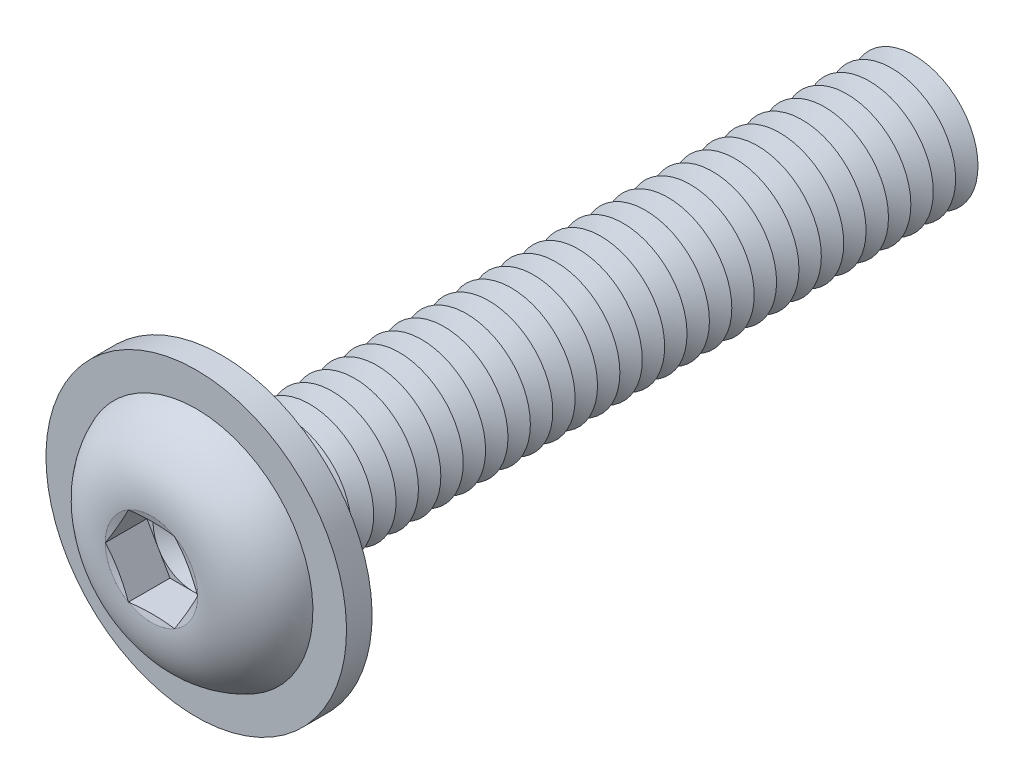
ISO-10303-21;
HEADER;
FILE_DESCRIPTION(('STEP AP214'),'2;1');
FILE_NAME('part.step','',(''),(''),'','','');
FILE_SCHEMA(('AUTOMOTIVE_DESIGN { 1 0 10303 214 1 1 1 1 }'));
ENDSEC;
DATA;
#1=APPLICATION_CONTEXT('core data for automotive mechanical design processes');
#2=APPLICATION_PROTOCOL_DEFINITION('international standard','automotive_design',2000,#1);
#3=PRODUCT_CONTEXT('',#1,'mechanical');
#4=PRODUCT('Part','Part','',(#3));
#5=PRODUCT_RELATED_PRODUCT_CATEGORY('part','',(#4));
#6=PRODUCT_DEFINITION_FORMATION('','',#4);
#7=PRODUCT_DEFINITION_CONTEXT('part definition',#1,'design');
#8=PRODUCT_DEFINITION('design','',#6,#7);
#9=PRODUCT_DEFINITION_SHAPE('','',#8);
#10=(LENGTH_UNIT() NAMED_UNIT(*) SI_UNIT(.MILLI.,.METRE.));
#11=(NAMED_UNIT(*) PLANE_ANGLE_UNIT() SI_UNIT($,.RADIAN.));
#12=(NAMED_UNIT(*) SI_UNIT($,.STERADIAN.) SOLID_ANGLE_UNIT());
#13=UNCERTAINTY_MEASURE_WITH_UNIT(LENGTH_MEASURE(1.E-05),#10,'distance_accuracy_value','');
#14=(GEOMETRIC_REPRESENTATION_CONTEXT(3) GLOBAL_UNCERTAINTY_ASSIGNED_CONTEXT((#13)) GLOBAL_UNIT_ASSIGNED_CONTEXT((#10,
#11,#12)) REPRESENTATION_CONTEXT('',''));
#15=CARTESIAN_POINT('',(0.,0.,0.));
#16=DIRECTION('',(0.,0.,1.));
#17=DIRECTION('',(1.,0.,0.));
#18=AXIS2_PLACEMENT_3D('',#15,#16,#17);
#19=CARTESIAN_POINT('',(0.,0.,-19.55));
#20=DIRECTION('',(0.,0.,1.));
#21=DIRECTION('',(1.,0.,0.));
#22=AXIS2_PLACEMENT_3D('',#19,#20,#21);
#23=CONICAL_SURFACE('',#22,2.00000000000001,1.0471975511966);
#24=CARTESIAN_POINT('',(0.,0.,-19.9));
#25=DIRECTION('',(0.,0.,1.));
#26=DIRECTION('',(1.,0.,0.));
#27=AXIS2_PLACEMENT_3D('',#24,#25,#26);
#28=CIRCLE('',#27,1.3937822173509);
#29=CARTESIAN_POINT('',(1.3937822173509,0.,-19.9));
#30=VERTEX_POINT('',#29);
#31=EDGE_CURVE('E458',#30,#30,#28,.T.);
#32=ORIENTED_EDGE('',*,*,#31,.T.);
#33=EDGE_LOOP('',(#32));
#34=FACE_BOUND('',#33,.T.);
#35=CARTESIAN_POINT('',(0.,0.,-19.55));
#36=DIRECTION('',(0.,0.,1.));
#37=DIRECTION('',(1.,0.,0.));
#38=AXIS2_PLACEMENT_3D('',#35,#36,#37);
#39=CIRCLE('',#38,2.00000000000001);
#40=CARTESIAN_POINT('',(2.00000000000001,0.,-19.55));
#41=VERTEX_POINT('',#40);
#42=EDGE_CURVE('E454',#41,#41,#39,.T.);
#43=ORIENTED_EDGE('',*,*,#42,.F.);
#44=EDGE_LOOP('',(#43));
#45=FACE_BOUND('',#44,.T.);
#46=ADVANCED_FACE('F39',(#34,#45),#23,.T.);
#47=CARTESIAN_POINT('',(0.,0.,-19.9));
#48=DIRECTION('',(0.,0.,-1.));
#49=DIRECTION('',(-1.,0.,0.));
#50=AXIS2_PLACEMENT_3D('',#47,#48,#49);
#51=CONICAL_SURFACE('',#50,1.3937822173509,1.0471975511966);
#52=CARTESIAN_POINT('',(0.,0.,-20.25));
#53=DIRECTION('',(0.,0.,1.));
#54=DIRECTION('',(1.,0.,0.));
#55=AXIS2_PLACEMENT_3D('',#52,#53,#54);
#56=CIRCLE('',#55,2.00000000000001);
#57=CARTESIAN_POINT('',(2.00000000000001,0.,-20.25));
#58=VERTEX_POINT('',#57);
#59=EDGE_CURVE('E462',#58,#58,#56,.T.);
#60=ORIENTED_EDGE('',*,*,#59,.T.);
#61=EDGE_LOOP('',(#60));
#62=FACE_BOUND('',#61,.T.);
#63=ORIENTED_EDGE('',*,*,#31,.F.);
#64=EDGE_LOOP('',(#63));
#65=FACE_BOUND('',#64,.T.);
#66=ADVANCED_FACE('F578',(#62,#65),#51,.T.);
#67=CARTESIAN_POINT('',(0.,2.00000000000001,-22.));
#68=DIRECTION('',(0.,0.,-1.));
#69=DIRECTION('',(-1.,0.,0.));
#70=AXIS2_PLACEMENT_3D('',#67,#68,#69);
#71=PLANE('',#70);
#72=CARTESIAN_POINT('',(0.,0.,-22.));
#73=DIRECTION('',(0.,0.,1.));
#74=DIRECTION('',(1.,0.,0.));
#75=AXIS2_PLACEMENT_3D('',#72,#73,#74);
#76=CIRCLE('',#75,1.3937822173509);
#77=CARTESIAN_POINT('',(1.3937822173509,0.,-22.));
#78=VERTEX_POINT('',#77);
#79=EDGE_CURVE('E482',#78,#78,#76,.T.);
#80=ORIENTED_EDGE('',*,*,#79,.F.);
#81=EDGE_LOOP('',(#80));
#82=FACE_BOUND('',#81,.T.);
#83=ADVANCED_FACE('F584',(#82),#71,.T.);
#84=CARTESIAN_POINT('',(0.,0.,-21.65));
#85=DIRECTION('',(0.,0.,1.));
#86=DIRECTION('',(1.,0.,0.));
#87=AXIS2_PLACEMENT_3D('',#84,#85,#86);
#88=CONICAL_SURFACE('',#87,2.00000000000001,1.0471975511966);
#89=ORIENTED_EDGE('',*,*,#79,.T.);
#90=EDGE_LOOP('',(#89));
#91=FACE_BOUND('',#90,.T.);
#92=CARTESIAN_POINT('',(0.,0.,-21.65));
#93=DIRECTION('',(0.,0.,1.));
#94=DIRECTION('',(1.,0.,0.));
#95=AXIS2_PLACEMENT_3D('',#92,#93,#94);
#96=CIRCLE('',#95,2.00000000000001);
#97=CARTESIAN_POINT('',(2.00000000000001,0.,-21.65));
#98=VERTEX_POINT('',#97);
#99=EDGE_CURVE('E478',#98,#98,#96,.T.);
#100=ORIENTED_EDGE('',*,*,#99,.F.);
#101=EDGE_LOOP('',(#100));
#102=FACE_BOUND('',#101,.T.);
#103=ADVANCED_FACE('F603',(#91,#102),#88,.T.);
#104=CARTESIAN_POINT('',(0.,0.,-21.3));
#105=DIRECTION('',(0.,0.,-1.));
#106=DIRECTION('',(-1.,0.,0.));
#107=AXIS2_PLACEMENT_3D('',#104,#105,#106);
#108=CONICAL_SURFACE('',#107,1.3937822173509,1.0471975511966);
#109=ORIENTED_EDGE('',*,*,#99,.T.);
#110=EDGE_LOOP('',(#109));
#111=FACE_BOUND('',#110,.T.);
#112=CARTESIAN_POINT('',(0.,0.,-21.3));
#113=DIRECTION('',(0.,0.,1.));
#114=DIRECTION('',(1.,0.,0.));
#115=AXIS2_PLACEMENT_3D('',#112,#113,#114);
#116=CIRCLE('',#115,1.3937822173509);
#117=CARTESIAN_POINT('',(1.3937822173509,0.,-21.3));
#118=VERTEX_POINT('',#117);
#119=EDGE_CURVE('E474',#118,#118,#116,.T.);
#120=ORIENTED_EDGE('',*,*,#119,.F.);
#121=EDGE_LOOP('',(#120));
#122=FACE_BOUND('',#121,.T.);
#123=ADVANCED_FACE('F600',(#111,#122),#108,.T.);
#124=CARTESIAN_POINT('',(0.,0.,-20.95));
#125=DIRECTION('',(0.,0.,1.));
#126=DIRECTION('',(1.,0.,0.));
#127=AXIS2_PLACEMENT_3D('',#124,#125,#126);
#128=CONICAL_SURFACE('',#127,2.00000000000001,1.0471975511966);
#129=ORIENTED_EDGE('',*,*,#119,.T.);
#130=EDGE_LOOP('',(#129));
#131=FACE_BOUND('',#130,.T.);
#132=CARTESIAN_POINT('',(0.,0.,-20.95));
#133=DIRECTION('',(0.,0.,1.));
#134=DIRECTION('',(1.,0.,0.));
#135=AXIS2_PLACEMENT_3D('',#132,#133,#134);
#136=CIRCLE('',#135,2.00000000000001);
#137=CARTESIAN_POINT('',(2.00000000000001,0.,-20.95));
#138=VERTEX_POINT('',#137);
#139=EDGE_CURVE('E470',#138,#138,#136,.T.);
#140=ORIENTED_EDGE('',*,*,#139,.F.);
#141=EDGE_LOOP('',(#140));
#142=FACE_BOUND('',#141,.T.);
#143=ADVANCED_FACE('F594',(#131,#142),#128,.T.);
#144=CARTESIAN_POINT('',(0.,0.,-20.6));
#145=DIRECTION('',(0.,0.,-1.));
#146=DIRECTION('',(-1.,0.,0.));
#147=AXIS2_PLACEMENT_3D('',#144,#145,#146);
#148=CONICAL_SURFACE('',#147,1.3937822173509,1.0471975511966);
#149=ORIENTED_EDGE('',*,*,#139,.T.);
#150=EDGE_LOOP('',(#149));
#151=FACE_BOUND('',#150,.T.);
#152=CARTESIAN_POINT('',(0.,0.,-20.6));
#153=DIRECTION('',(0.,0.,1.));
#154=DIRECTION('',(1.,0.,0.));
#155=AXIS2_PLACEMENT_3D('',#152,#153,#154);
#156=CIRCLE('',#155,1.3937822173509);
#157=CARTESIAN_POINT('',(1.3937822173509,0.,-20.6));
#158=VERTEX_POINT('',#157);
#159=EDGE_CURVE('E466',#158,#158,#156,.T.);
#160=ORIENTED_EDGE('',*,*,#159,.F.);
#161=EDGE_LOOP('',(#160));
#162=FACE_BOUND('',#161,.T.);
#163=ADVANCED_FACE('F590',(#151,#162),#148,.T.);
#164=CARTESIAN_POINT('',(0.,0.,-20.25));
#165=DIRECTION('',(0.,0.,1.));
#166=DIRECTION('',(1.,0.,0.));
#167=AXIS2_PLACEMENT_3D('',#164,#165,#166);
#168=CONICAL_SURFACE('',#167,2.00000000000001,1.0471975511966);
#169=ORIENTED_EDGE('',*,*,#159,.T.);
#170=EDGE_LOOP('',(#169));
#171=FACE_BOUND('',#170,.T.);
#172=ORIENTED_EDGE('',*,*,#59,.F.);
#173=EDGE_LOOP('',(#172));
#174=FACE_BOUND('',#173,.T.);
#175=ADVANCED_FACE('F593',(#171,#174),#168,.T.);
#176=CARTESIAN_POINT('',(0.,0.,-18.85));
#177=DIRECTION('',(0.,0.,1.));
#178=DIRECTION('',(1.,0.,0.));
#179=AXIS2_PLACEMENT_3D('',#176,#177,#178);
#180=CONICAL_SURFACE('',#179,2.00000000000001,1.0471975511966);
#181=CARTESIAN_POINT('',(0.,0.,-19.2));
#182=DIRECTION('',(0.,0.,1.));
#183=DIRECTION('',(1.,0.,0.));
#184=AXIS2_PLACEMENT_3D('',#181,#182,#183);
#185=CIRCLE('',#184,1.3937822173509);
#186=CARTESIAN_POINT('',(1.3937822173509,0.,-19.2));
#187=VERTEX_POINT('',#186);
#188=EDGE_CURVE('E450',#187,#187,#185,.T.);
#189=ORIENTED_EDGE('',*,*,#188,.T.);
#190=EDGE_LOOP('',(#189));
#191=FACE_BOUND('',#190,.T.);
#192=CARTESIAN_POINT('',(0.,0.,-18.85));
#193=DIRECTION('',(0.,0.,1.));
#194=DIRECTION('',(1.,0.,0.));
#195=AXIS2_PLACEMENT_3D('',#192,#193,#194);
#196=CIRCLE('',#195,2.00000000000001);
#197=CARTESIAN_POINT('',(2.00000000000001,0.,-18.85));
#198=VERTEX_POINT('',#197);
#199=EDGE_CURVE('E446',#198,#198,#196,.T.);
#200=ORIENTED_EDGE('',*,*,#199,.F.);
#201=EDGE_LOOP('',(#200));
#202=FACE_BOUND('',#201,.T.);
#203=ADVANCED_FACE('F598',(#191,#202),#180,.T.);
#204=CARTESIAN_POINT('',(0.,0.,-19.2));
#205=DIRECTION('',(0.,0.,-1.));
#206=DIRECTION('',(-1.,0.,0.));
#207=AXIS2_PLACEMENT_3D('',#204,#205,#206);
#208=CONICAL_SURFACE('',#207,1.3937822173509,1.0471975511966);
#209=ORIENTED_EDGE('',*,*,#42,.T.);
#210=EDGE_LOOP('',(#209));
#211=FACE_BOUND('',#210,.T.);
#212=ORIENTED_EDGE('',*,*,#188,.F.);
#213=EDGE_LOOP('',(#212));
#214=FACE_BOUND('',#213,.T.);
#215=ADVANCED_FACE('F649',(#211,#214),#208,.T.);
#216=CARTESIAN_POINT('',(0.,0.,-18.15));
#217=DIRECTION('',(0.,0.,1.));
#218=DIRECTION('',(1.,0.,0.));
#219=AXIS2_PLACEMENT_3D('',#216,#217,#218);
#220=CONICAL_SURFACE('',#219,2.00000000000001,1.0471975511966);
#221=CARTESIAN_POINT('',(0.,0.,-18.5));
#222=DIRECTION('',(0.,0.,1.));
#223=DIRECTION('',(1.,0.,0.));
#224=AXIS2_PLACEMENT_3D('',#221,#222,#223);
#225=CIRCLE('',#224,1.3937822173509);
#226=CARTESIAN_POINT('',(1.3937822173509,0.,-18.5));
#227=VERTEX_POINT('',#226);
#228=EDGE_CURVE('E442',#227,#227,#225,.T.);
#229=ORIENTED_EDGE('',*,*,#228,.T.);
#230=EDGE_LOOP('',(#229));
#231=FACE_BOUND('',#230,.T.);
#232=CARTESIAN_POINT('',(0.,0.,-18.15));
#233=DIRECTION('',(0.,0.,1.));
#234=DIRECTION('',(1.,0.,0.));
#235=AXIS2_PLACEMENT_3D('',#232,#233,#234);
#236=CIRCLE('',#235,2.00000000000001);
#237=CARTESIAN_POINT('',(2.00000000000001,0.,-18.15));
#238=VERTEX_POINT('',#237);
#239=EDGE_CURVE('E438',#238,#238,#236,.T.);
#240=ORIENTED_EDGE('',*,*,#239,.F.);
#241=EDGE_LOOP('',(#240));
#242=FACE_BOUND('',#241,.T.);
#243=ADVANCED_FACE('F655',(#231,#242),#220,.T.);
#244=CARTESIAN_POINT('',(0.,0.,-18.5));
#245=DIRECTION('',(0.,0.,-1.));
#246=DIRECTION('',(-1.,0.,0.));
#247=AXIS2_PLACEMENT_3D('',#244,#245,#246);
#248=CONICAL_SURFACE('',#247,1.3937822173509,1.0471975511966);
#249=ORIENTED_EDGE('',*,*,#199,.T.);
#250=EDGE_LOOP('',(#249));
#251=FACE_BOUND('',#250,.T.);
#252=ORIENTED_EDGE('',*,*,#228,.F.);
#253=EDGE_LOOP('',(#252));
#254=FACE_BOUND('',#253,.T.);
#255=ADVANCED_FACE('F662',(#251,#254),#248,.T.);
#256=CARTESIAN_POINT('',(0.,0.,-17.45));
#257=DIRECTION('',(0.,0.,1.));
#258=DIRECTION('',(1.,0.,0.));
#259=AXIS2_PLACEMENT_3D('',#256,#257,#258);
#260=CONICAL_SURFACE('',#259,2.00000000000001,1.0471975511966);
#261=CARTESIAN_POINT('',(0.,0.,-17.8));
#262=DIRECTION('',(0.,0.,1.));
#263=DIRECTION('',(1.,0.,0.));
#264=AXIS2_PLACEMENT_3D('',#261,#262,#263);
#265=CIRCLE('',#264,1.3937822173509);
#266=CARTESIAN_POINT('',(1.3937822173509,0.,-17.8));
#267=VERTEX_POINT('',#266);
#268=EDGE_CURVE('E434',#267,#267,#265,.T.);
#269=ORIENTED_EDGE('',*,*,#268,.T.);
#270=EDGE_LOOP('',(#269));
#271=FACE_BOUND('',#270,.T.);
#272=CARTESIAN_POINT('',(0.,0.,-17.45));
#273=DIRECTION('',(0.,0.,1.));
#274=DIRECTION('',(1.,0.,0.));
#275=AXIS2_PLACEMENT_3D('',#272,#273,#274);
#276=CIRCLE('',#275,2.00000000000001);
#277=CARTESIAN_POINT('',(2.00000000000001,0.,-17.45));
#278=VERTEX_POINT('',#277);
#279=EDGE_CURVE('E430',#278,#278,#276,.T.);
#280=ORIENTED_EDGE('',*,*,#279,.F.);
#281=EDGE_LOOP('',(#280));
#282=FACE_BOUND('',#281,.T.);
#283=ADVANCED_FACE('F669',(#271,#282),#260,.T.);
#284=CARTESIAN_POINT('',(0.,0.,-17.8));
#285=DIRECTION('',(0.,0.,-1.));
#286=DIRECTION('',(-1.,0.,0.));
#287=AXIS2_PLACEMENT_3D('',#284,#285,#286);
#288=CONICAL_SURFACE('',#287,1.3937822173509,1.0471975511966);
#289=ORIENTED_EDGE('',*,*,#239,.T.);
#290=EDGE_LOOP('',(#289));
#291=FACE_BOUND('',#290,.T.);
#292=ORIENTED_EDGE('',*,*,#268,.F.);
#293=EDGE_LOOP('',(#292));
#294=FACE_BOUND('',#293,.T.);
#295=ADVANCED_FACE('F676',(#291,#294),#288,.T.);
#296=CARTESIAN_POINT('',(0.,0.,-16.75));
#297=DIRECTION('',(0.,0.,1.));
#298=DIRECTION('',(1.,0.,0.));
#299=AXIS2_PLACEMENT_3D('',#296,#297,#298);
#300=CONICAL_SURFACE('',#299,2.00000000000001,1.0471975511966);
#301=CARTESIAN_POINT('',(0.,0.,-17.1));
#302=DIRECTION('',(0.,0.,1.));
#303=DIRECTION('',(1.,0.,0.));
#304=AXIS2_PLACEMENT_3D('',#301,#302,#303);
#305=CIRCLE('',#304,1.3937822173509);
#306=CARTESIAN_POINT('',(1.3937822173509,0.,-17.1));
#307=VERTEX_POINT('',#306);
#308=EDGE_CURVE('E426',#307,#307,#305,.T.);
#309=ORIENTED_EDGE('',*,*,#308,.T.);
#310=EDGE_LOOP('',(#309));
#311=FACE_BOUND('',#310,.T.);
#312=CARTESIAN_POINT('',(0.,0.,-16.75));
#313=DIRECTION('',(0.,0.,1.));
#314=DIRECTION('',(1.,0.,0.));
#315=AXIS2_PLACEMENT_3D('',#312,#313,#314);
#316=CIRCLE('',#315,2.00000000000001);
#317=CARTESIAN_POINT('',(2.00000000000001,0.,-16.75));
#318=VERTEX_POINT('',#317);
#319=EDGE_CURVE('E422',#318,#318,#316,.T.);
#320=ORIENTED_EDGE('',*,*,#319,.F.);
#321=EDGE_LOOP('',(#320));
#322=FACE_BOUND('',#321,.T.);
#323=ADVANCED_FACE('F683',(#311,#322),#300,.T.);
#324=CARTESIAN_POINT('',(0.,0.,-17.1));
#325=DIRECTION('',(0.,0.,-1.));
#326=DIRECTION('',(-1.,0.,0.));
#327=AXIS2_PLACEMENT_3D('',#324,#325,#326);
#328=CONICAL_SURFACE('',#327,1.3937822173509,1.0471975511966);
#329=ORIENTED_EDGE('',*,*,#279,.T.);
#330=EDGE_LOOP('',(#329));
#331=FACE_BOUND('',#330,.T.);
#332=ORIENTED_EDGE('',*,*,#308,.F.);
#333=EDGE_LOOP('',(#332));
#334=FACE_BOUND('',#333,.T.);
#335=ADVANCED_FACE('F690',(#331,#334),#328,.T.);
#336=CARTESIAN_POINT('',(0.,0.,-16.05));
#337=DIRECTION('',(0.,0.,1.));
#338=DIRECTION('',(1.,0.,0.));
#339=AXIS2_PLACEMENT_3D('',#336,#337,#338);
#340=CONICAL_SURFACE('',#339,2.00000000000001,1.0471975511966);
#341=CARTESIAN_POINT('',(0.,0.,-16.4));
#342=DIRECTION('',(0.,0.,1.));
#343=DIRECTION('',(1.,0.,0.));
#344=AXIS2_PLACEMENT_3D('',#341,#342,#343);
#345=CIRCLE('',#344,1.3937822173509);
#346=CARTESIAN_POINT('',(1.3937822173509,0.,-16.4));
#347=VERTEX_POINT('',#346);
#348=EDGE_CURVE('E418',#347,#347,#345,.T.);
#349=ORIENTED_EDGE('',*,*,#348,.T.);
#350=EDGE_LOOP('',(#349));
#351=FACE_BOUND('',#350,.T.);
#352=CARTESIAN_POINT('',(0.,0.,-16.05));
#353=DIRECTION('',(0.,0.,1.));
#354=DIRECTION('',(1.,0.,0.));
#355=AXIS2_PLACEMENT_3D('',#352,#353,#354);
#356=CIRCLE('',#355,2.00000000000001);
#357=CARTESIAN_POINT('',(2.00000000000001,0.,-16.05));
#358=VERTEX_POINT('',#357);
#359=EDGE_CURVE('E414',#358,#358,#356,.T.);
#360=ORIENTED_EDGE('',*,*,#359,.F.);
#361=EDGE_LOOP('',(#360));
#362=FACE_BOUND('',#361,.T.);
#363=ADVANCED_FACE('F697',(#351,#362),#340,.T.);
#364=CARTESIAN_POINT('',(0.,0.,-16.4));
#365=DIRECTION('',(0.,0.,-1.));
#366=DIRECTION('',(-1.,0.,0.));
#367=AXIS2_PLACEMENT_3D('',#364,#365,#366);
#368=CONICAL_SURFACE('',#367,1.3937822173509,1.0471975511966);
#369=ORIENTED_EDGE('',*,*,#319,.T.);
#370=EDGE_LOOP('',(#369));
#371=FACE_BOUND('',#370,.T.);
#372=ORIENTED_EDGE('',*,*,#348,.F.);
#373=EDGE_LOOP('',(#372));
#374=FACE_BOUND('',#373,.T.);
#375=ADVANCED_FACE('F704',(#371,#374),#368,.T.);
#376=CARTESIAN_POINT('',(0.,0.,-15.35));
#377=DIRECTION('',(0.,0.,1.));
#378=DIRECTION('',(1.,0.,0.));
#379=AXIS2_PLACEMENT_3D('',#376,#377,#378);
#380=CONICAL_SURFACE('',#379,2.00000000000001,1.0471975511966);
#381=CARTESIAN_POINT('',(0.,0.,-15.7));
#382=DIRECTION('',(0.,0.,1.));
#383=DIRECTION('',(1.,0.,0.));
#384=AXIS2_PLACEMENT_3D('',#381,#382,#383);
#385=CIRCLE('',#384,1.3937822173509);
#386=CARTESIAN_POINT('',(1.3937822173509,0.,-15.7));
#387=VERTEX_POINT('',#386);
#388=EDGE_CURVE('E410',#387,#387,#385,.T.);
#389=ORIENTED_EDGE('',*,*,#388,.T.);
#390=EDGE_LOOP('',(#389));
#391=FACE_BOUND('',#390,.T.);
#392=CARTESIAN_POINT('',(0.,0.,-15.35));
#393=DIRECTION('',(0.,0.,1.));
#394=DIRECTION('',(1.,0.,0.));
#395=AXIS2_PLACEMENT_3D('',#392,#393,#394);
#396=CIRCLE('',#395,2.00000000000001);
#397=CARTESIAN_POINT('',(2.00000000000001,0.,-15.35));
#398=VERTEX_POINT('',#397);
#399=EDGE_CURVE('E406',#398,#398,#396,.T.);
#400=ORIENTED_EDGE('',*,*,#399,.F.);
#401=EDGE_LOOP('',(#400));
#402=FACE_BOUND('',#401,.T.);
#403=ADVANCED_FACE('F711',(#391,#402),#380,.T.);
#404=CARTESIAN_POINT('',(0.,0.,-15.7));
#405=DIRECTION('',(0.,0.,-1.));
#406=DIRECTION('',(-1.,0.,0.));
#407=AXIS2_PLACEMENT_3D('',#404,#405,#406);
#408=CONICAL_SURFACE('',#407,1.3937822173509,1.0471975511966);
#409=ORIENTED_EDGE('',*,*,#359,.T.);
#410=EDGE_LOOP('',(#409));
#411=FACE_BOUND('',#410,.T.);
#412=ORIENTED_EDGE('',*,*,#388,.F.);
#413=EDGE_LOOP('',(#412));
#414=FACE_BOUND('',#413,.T.);
#415=ADVANCED_FACE('F718',(#411,#414),#408,.T.);
#416=CARTESIAN_POINT('',(0.,0.,-14.65));
#417=DIRECTION('',(0.,0.,1.));
#418=DIRECTION('',(1.,0.,0.));
#419=AXIS2_PLACEMENT_3D('',#416,#417,#418);
#420=CONICAL_SURFACE('',#419,2.00000000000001,1.0471975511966);
#421=CARTESIAN_POINT('',(0.,0.,-15.));
#422=DIRECTION('',(0.,0.,1.));
#423=DIRECTION('',(1.,0.,0.));
#424=AXIS2_PLACEMENT_3D('',#421,#422,#423);
#425=CIRCLE('',#424,1.3937822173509);
#426=CARTESIAN_POINT('',(1.3937822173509,0.,-15.));
#427=VERTEX_POINT('',#426);
#428=EDGE_CURVE('E402',#427,#427,#425,.T.);
#429=ORIENTED_EDGE('',*,*,#428,.T.);
#430=EDGE_LOOP('',(#429));
#431=FACE_BOUND('',#430,.T.);
#432=CARTESIAN_POINT('',(0.,0.,-14.65));
#433=DIRECTION('',(0.,0.,1.));
#434=DIRECTION('',(1.,0.,0.));
#435=AXIS2_PLACEMENT_3D('',#432,#433,#434);
#436=CIRCLE('',#435,2.00000000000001);
#437=CARTESIAN_POINT('',(2.00000000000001,0.,-14.65));
#438=VERTEX_POINT('',#437);
#439=EDGE_CURVE('E398',#438,#438,#436,.T.);
#440=ORIENTED_EDGE('',*,*,#439,.F.);
#441=EDGE_LOOP('',(#440));
#442=FACE_BOUND('',#441,.T.);
#443=ADVANCED_FACE('F725',(#431,#442),#420,.T.);
#444=CARTESIAN_POINT('',(0.,0.,-15.));
#445=DIRECTION('',(0.,0.,-1.));
#446=DIRECTION('',(-1.,0.,0.));
#447=AXIS2_PLACEMENT_3D('',#444,#445,#446);
#448=CONICAL_SURFACE('',#447,1.3937822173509,1.0471975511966);
#449=ORIENTED_EDGE('',*,*,#399,.T.);
#450=EDGE_LOOP('',(#449));
#451=FACE_BOUND('',#450,.T.);
#452=ORIENTED_EDGE('',*,*,#428,.F.);
#453=EDGE_LOOP('',(#452));
#454=FACE_BOUND('',#453,.T.);
#455=ADVANCED_FACE('F732',(#451,#454),#448,.T.);
#456=CARTESIAN_POINT('',(0.,0.,-13.95));
#457=DIRECTION('',(0.,0.,1.));
#458=DIRECTION('',(1.,0.,0.));
#459=AXIS2_PLACEMENT_3D('',#456,#457,#458);
#460=CONICAL_SURFACE('',#459,2.00000000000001,1.0471975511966);
#461=CARTESIAN_POINT('',(0.,0.,-14.3));
#462=DIRECTION('',(0.,0.,1.));
#463=DIRECTION('',(1.,0.,0.));
#464=AXIS2_PLACEMENT_3D('',#461,#462,#463);
#465=CIRCLE('',#464,1.3937822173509);
#466=CARTESIAN_POINT('',(1.3937822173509,0.,-14.3));
#467=VERTEX_POINT('',#466);
#468=EDGE_CURVE('E394',#467,#467,#465,.T.);
#469=ORIENTED_EDGE('',*,*,#468,.T.);
#470=EDGE_LOOP('',(#469));
#471=FACE_BOUND('',#470,.T.);
#472=CARTESIAN_POINT('',(0.,0.,-13.95));
#473=DIRECTION('',(0.,0.,1.));
#474=DIRECTION('',(1.,0.,0.));
#475=AXIS2_PLACEMENT_3D('',#472,#473,#474);
#476=CIRCLE('',#475,2.00000000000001);
#477=CARTESIAN_POINT('',(2.00000000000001,0.,-13.95));
#478=VERTEX_POINT('',#477);
#479=EDGE_CURVE('E390',#478,#478,#476,.T.);
#480=ORIENTED_EDGE('',*,*,#479,.F.);
#481=EDGE_LOOP('',(#480));
#482=FACE_BOUND('',#481,.T.);
#483=ADVANCED_FACE('F739',(#471,#482),#460,.T.);
#484=CARTESIAN_POINT('',(0.,0.,-14.3));
#485=DIRECTION('',(0.,0.,-1.));
#486=DIRECTION('',(-1.,0.,0.));
#487=AXIS2_PLACEMENT_3D('',#484,#485,#486);
#488=CONICAL_SURFACE('',#487,1.3937822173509,1.0471975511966);
#489=ORIENTED_EDGE('',*,*,#439,.T.);
#490=EDGE_LOOP('',(#489));
#491=FACE_BOUND('',#490,.T.);
#492=ORIENTED_EDGE('',*,*,#468,.F.);
#493=EDGE_LOOP('',(#492));
#494=FACE_BOUND('',#493,.T.);
#495=ADVANCED_FACE('F746',(#491,#494),#488,.T.);
#496=CARTESIAN_POINT('',(0.,0.,-13.25));
#497=DIRECTION('',(0.,0.,1.));
#498=DIRECTION('',(1.,0.,0.));
#499=AXIS2_PLACEMENT_3D('',#496,#497,#498);
#500=CONICAL_SURFACE('',#499,2.00000000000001,1.0471975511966);
#501=CARTESIAN_POINT('',(0.,0.,-13.6));
#502=DIRECTION('',(0.,0.,1.));
#503=DIRECTION('',(1.,0.,0.));
#504=AXIS2_PLACEMENT_3D('',#501,#502,#503);
#505=CIRCLE('',#504,1.3937822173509);
#506=CARTESIAN_POINT('',(1.3937822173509,0.,-13.6));
#507=VERTEX_POINT('',#506);
#508=EDGE_CURVE('E386',#507,#507,#505,.T.);
#509=ORIENTED_EDGE('',*,*,#508,.T.);
#510=EDGE_LOOP('',(#509));
#511=FACE_BOUND('',#510,.T.);
#512=CARTESIAN_POINT('',(0.,0.,-13.25));
#513=DIRECTION('',(0.,0.,1.));
#514=DIRECTION('',(1.,0.,0.));
#515=AXIS2_PLACEMENT_3D('',#512,#513,#514);
#516=CIRCLE('',#515,2.00000000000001);
#517=CARTESIAN_POINT('',(2.00000000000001,0.,-13.25));
#518=VERTEX_POINT('',#517);
#519=EDGE_CURVE('E382',#518,#518,#516,.T.);
#520=ORIENTED_EDGE('',*,*,#519,.F.);
#521=EDGE_LOOP('',(#520));
#522=FACE_BOUND('',#521,.T.);
#523=ADVANCED_FACE('F753',(#511,#522),#500,.T.);
#524=CARTESIAN_POINT('',(0.,0.,-13.6));
#525=DIRECTION('',(0.,0.,-1.));
#526=DIRECTION('',(-1.,0.,0.));
#527=AXIS2_PLACEMENT_3D('',#524,#525,#526);
#528=CONICAL_SURFACE('',#527,1.3937822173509,1.0471975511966);
#529=ORIENTED_EDGE('',*,*,#479,.T.);
#530=EDGE_LOOP('',(#529));
#531=FACE_BOUND('',#530,.T.);
#532=ORIENTED_EDGE('',*,*,#508,.F.);
#533=EDGE_LOOP('',(#532));
#534=FACE_BOUND('',#533,.T.);
#535=ADVANCED_FACE('F760',(#531,#534),#528,.T.);
#536=CARTESIAN_POINT('',(0.,0.,-12.55));
#537=DIRECTION('',(0.,0.,1.));
#538=DIRECTION('',(1.,0.,0.));
#539=AXIS2_PLACEMENT_3D('',#536,#537,#538);
#540=CONICAL_SURFACE('',#539,2.00000000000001,1.0471975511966);
#541=CARTESIAN_POINT('',(0.,0.,-12.9));
#542=DIRECTION('',(0.,0.,1.));
#543=DIRECTION('',(1.,0.,0.));
#544=AXIS2_PLACEMENT_3D('',#541,#542,#543);
#545=CIRCLE('',#544,1.3937822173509);
#546=CARTESIAN_POINT('',(1.3937822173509,0.,-12.9));
#547=VERTEX_POINT('',#546);
#548=EDGE_CURVE('E378',#547,#547,#545,.T.);
#549=ORIENTED_EDGE('',*,*,#548,.T.);
#550=EDGE_LOOP('',(#549));
#551=FACE_BOUND('',#550,.T.);
#552=CARTESIAN_POINT('',(0.,0.,-12.55));
#553=DIRECTION('',(0.,0.,1.));
#554=DIRECTION('',(1.,0.,0.));
#555=AXIS2_PLACEMENT_3D('',#552,#553,#554);
#556=CIRCLE('',#555,2.00000000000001);
#557=CARTESIAN_POINT('',(2.00000000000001,0.,-12.55));
#558=VERTEX_POINT('',#557);
#559=EDGE_CURVE('E374',#558,#558,#556,.T.);
#560=ORIENTED_EDGE('',*,*,#559,.F.);
#561=EDGE_LOOP('',(#560));
#562=FACE_BOUND('',#561,.T.);
#563=ADVANCED_FACE('F767',(#551,#562),#540,.T.);
#564=CARTESIAN_POINT('',(0.,0.,-12.9));
#565=DIRECTION('',(0.,0.,-1.));
#566=DIRECTION('',(-1.,0.,0.));
#567=AXIS2_PLACEMENT_3D('',#564,#565,#566);
#568=CONICAL_SURFACE('',#567,1.3937822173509,1.0471975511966);
#569=ORIENTED_EDGE('',*,*,#519,.T.);
#570=EDGE_LOOP('',(#569));
#571=FACE_BOUND('',#570,.T.);
#572=ORIENTED_EDGE('',*,*,#548,.F.);
#573=EDGE_LOOP('',(#572));
#574=FACE_BOUND('',#573,.T.);
#575=ADVANCED_FACE('F774',(#571,#574),#568,.T.);
#576=CARTESIAN_POINT('',(0.,0.,-11.85));
#577=DIRECTION('',(0.,0.,1.));
#578=DIRECTION('',(1.,0.,0.));
#579=AXIS2_PLACEMENT_3D('',#576,#577,#578);
#580=CONICAL_SURFACE('',#579,2.00000000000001,1.0471975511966);
#581=CARTESIAN_POINT('',(0.,0.,-12.2));
#582=DIRECTION('',(0.,0.,1.));
#583=DIRECTION('',(1.,0.,0.));
#584=AXIS2_PLACEMENT_3D('',#581,#582,#583);
#585=CIRCLE('',#584,1.3937822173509);
#586=CARTESIAN_POINT('',(1.3937822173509,0.,-12.2));
#587=VERTEX_POINT('',#586);
#588=EDGE_CURVE('E370',#587,#587,#585,.T.);
#589=ORIENTED_EDGE('',*,*,#588,.T.);
#590=EDGE_LOOP('',(#589));
#591=FACE_BOUND('',#590,.T.);
#592=CARTESIAN_POINT('',(0.,0.,-11.85));
#593=DIRECTION('',(0.,0.,1.));
#594=DIRECTION('',(1.,0.,0.));
#595=AXIS2_PLACEMENT_3D('',#592,#593,#594);
#596=CIRCLE('',#595,2.00000000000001);
#597=CARTESIAN_POINT('',(2.00000000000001,0.,-11.85));
#598=VERTEX_POINT('',#597);
#599=EDGE_CURVE('E366',#598,#598,#596,.T.);
#600=ORIENTED_EDGE('',*,*,#599,.F.);
#601=EDGE_LOOP('',(#600));
#602=FACE_BOUND('',#601,.T.);
#603=ADVANCED_FACE('F781',(#591,#602),#580,.T.);
#604=CARTESIAN_POINT('',(0.,0.,-12.2));
#605=DIRECTION('',(0.,0.,-1.));
#606=DIRECTION('',(-1.,0.,0.));
#607=AXIS2_PLACEMENT_3D('',#604,#605,#606);
#608=CONICAL_SURFACE('',#607,1.3937822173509,1.0471975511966);
#609=ORIENTED_EDGE('',*,*,#559,.T.);
#610=EDGE_LOOP('',(#609));
#611=FACE_BOUND('',#610,.T.);
#612=ORIENTED_EDGE('',*,*,#588,.F.);
#613=EDGE_LOOP('',(#612));
#614=FACE_BOUND('',#613,.T.);
#615=ADVANCED_FACE('F788',(#611,#614),#608,.T.);
#616=CARTESIAN_POINT('',(0.,0.,-11.15));
#617=DIRECTION('',(0.,0.,1.));
#618=DIRECTION('',(1.,0.,0.));
#619=AXIS2_PLACEMENT_3D('',#616,#617,#618);
#620=CONICAL_SURFACE('',#619,2.00000000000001,1.0471975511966);
#621=CARTESIAN_POINT('',(0.,0.,-11.5));
#622=DIRECTION('',(0.,0.,1.));
#623=DIRECTION('',(1.,0.,0.));
#624=AXIS2_PLACEMENT_3D('',#621,#622,#623);
#625=CIRCLE('',#624,1.3937822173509);
#626=CARTESIAN_POINT('',(1.3937822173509,0.,-11.5));
#627=VERTEX_POINT('',#626);
#628=EDGE_CURVE('E362',#627,#627,#625,.T.);
#629=ORIENTED_EDGE('',*,*,#628,.T.);
#630=EDGE_LOOP('',(#629));
#631=FACE_BOUND('',#630,.T.);
#632=CARTESIAN_POINT('',(0.,0.,-11.15));
#633=DIRECTION('',(0.,0.,1.));
#634=DIRECTION('',(1.,0.,0.));
#635=AXIS2_PLACEMENT_3D('',#632,#633,#634);
#636=CIRCLE('',#635,2.00000000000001);
#637=CARTESIAN_POINT('',(2.00000000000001,0.,-11.15));
#638=VERTEX_POINT('',#637);
#639=EDGE_CURVE('E358',#638,#638,#636,.T.);
#640=ORIENTED_EDGE('',*,*,#639,.F.);
#641=EDGE_LOOP('',(#640));
#642=FACE_BOUND('',#641,.T.);
#643=ADVANCED_FACE('F795',(#631,#642),#620,.T.);
#644=CARTESIAN_POINT('',(0.,0.,-11.5));
#645=DIRECTION('',(0.,0.,-1.));
#646=DIRECTION('',(-1.,0.,0.));
#647=AXIS2_PLACEMENT_3D('',#644,#645,#646);
#648=CONICAL_SURFACE('',#647,1.3937822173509,1.0471975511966);
#649=ORIENTED_EDGE('',*,*,#599,.T.);
#650=EDGE_LOOP('',(#649));
#651=FACE_BOUND('',#650,.T.);
#652=ORIENTED_EDGE('',*,*,#628,.F.);
#653=EDGE_LOOP('',(#652));
#654=FACE_BOUND('',#653,.T.);
#655=ADVANCED_FACE('F802',(#651,#654),#648,.T.);
#656=CARTESIAN_POINT('',(0.,0.,-10.45));
#657=DIRECTION('',(0.,0.,1.));
#658=DIRECTION('',(1.,0.,0.));
#659=AXIS2_PLACEMENT_3D('',#656,#657,#658);
#660=CONICAL_SURFACE('',#659,2.00000000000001,1.0471975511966);
#661=CARTESIAN_POINT('',(0.,0.,-10.8));
#662=DIRECTION('',(0.,0.,1.));
#663=DIRECTION('',(1.,0.,0.));
#664=AXIS2_PLACEMENT_3D('',#661,#662,#663);
#665=CIRCLE('',#664,1.3937822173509);
#666=CARTESIAN_POINT('',(1.3937822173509,0.,-10.8));
#667=VERTEX_POINT('',#666);
#668=EDGE_CURVE('E354',#667,#667,#665,.T.);
#669=ORIENTED_EDGE('',*,*,#668,.T.);
#670=EDGE_LOOP('',(#669));
#671=FACE_BOUND('',#670,.T.);
#672=CARTESIAN_POINT('',(0.,0.,-10.45));
#673=DIRECTION('',(0.,0.,1.));
#674=DIRECTION('',(1.,0.,0.));
#675=AXIS2_PLACEMENT_3D('',#672,#673,#674);
#676=CIRCLE('',#675,2.00000000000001);
#677=CARTESIAN_POINT('',(2.00000000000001,0.,-10.45));
#678=VERTEX_POINT('',#677);
#679=EDGE_CURVE('E350',#678,#678,#676,.T.);
#680=ORIENTED_EDGE('',*,*,#679,.F.);
#681=EDGE_LOOP('',(#680));
#682=FACE_BOUND('',#681,.T.);
#683=ADVANCED_FACE('F809',(#671,#682),#660,.T.);
#684=CARTESIAN_POINT('',(0.,0.,-10.8));
#685=DIRECTION('',(0.,0.,-1.));
#686=DIRECTION('',(-1.,0.,0.));
#687=AXIS2_PLACEMENT_3D('',#684,#685,#686);
#688=CONICAL_SURFACE('',#687,1.3937822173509,1.0471975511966);
#689=ORIENTED_EDGE('',*,*,#639,.T.);
#690=EDGE_LOOP('',(#689));
#691=FACE_BOUND('',#690,.T.);
#692=ORIENTED_EDGE('',*,*,#668,.F.);
#693=EDGE_LOOP('',(#692));
#694=FACE_BOUND('',#693,.T.);
#695=ADVANCED_FACE('F816',(#691,#694),#688,.T.);
#696=CARTESIAN_POINT('',(0.,0.,-9.75));
#697=DIRECTION('',(0.,0.,1.));
#698=DIRECTION('',(1.,0.,0.));
#699=AXIS2_PLACEMENT_3D('',#696,#697,#698);
#700=CONICAL_SURFACE('',#699,2.00000000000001,1.0471975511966);
#701=CARTESIAN_POINT('',(0.,0.,-10.1));
#702=DIRECTION('',(0.,0.,1.));
#703=DIRECTION('',(1.,0.,0.));
#704=AXIS2_PLACEMENT_3D('',#701,#702,#703);
#705=CIRCLE('',#704,1.3937822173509);
#706=CARTESIAN_POINT('',(1.3937822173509,0.,-10.1));
#707=VERTEX_POINT('',#706);
#708=EDGE_CURVE('E346',#707,#707,#705,.T.);
#709=ORIENTED_EDGE('',*,*,#708,.T.);
#710=EDGE_LOOP('',(#709));
#711=FACE_BOUND('',#710,.T.);
#712=CARTESIAN_POINT('',(0.,0.,-9.75));
#713=DIRECTION('',(0.,0.,1.));
#714=DIRECTION('',(1.,0.,0.));
#715=AXIS2_PLACEMENT_3D('',#712,#713,#714);
#716=CIRCLE('',#715,2.00000000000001);
#717=CARTESIAN_POINT('',(2.00000000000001,0.,-9.75));
#718=VERTEX_POINT('',#717);
#719=EDGE_CURVE('E342',#718,#718,#716,.T.);
#720=ORIENTED_EDGE('',*,*,#719,.F.);
#721=EDGE_LOOP('',(#720));
#722=FACE_BOUND('',#721,.T.);
#723=ADVANCED_FACE('F823',(#711,#722),#700,.T.);
#724=CARTESIAN_POINT('',(0.,0.,-10.1));
#725=DIRECTION('',(0.,0.,-1.));
#726=DIRECTION('',(-1.,0.,0.));
#727=AXIS2_PLACEMENT_3D('',#724,#725,#726);
#728=CONICAL_SURFACE('',#727,1.3937822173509,1.0471975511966);
#729=ORIENTED_EDGE('',*,*,#679,.T.);
#730=EDGE_LOOP('',(#729));
#731=FACE_BOUND('',#730,.T.);
#732=ORIENTED_EDGE('',*,*,#708,.F.);
#733=EDGE_LOOP('',(#732));
#734=FACE_BOUND('',#733,.T.);
#735=ADVANCED_FACE('F830',(#731,#734),#728,.T.);
#736=CARTESIAN_POINT('',(0.,0.,-9.05));
#737=DIRECTION('',(0.,0.,1.));
#738=DIRECTION('',(1.,0.,0.));
#739=AXIS2_PLACEMENT_3D('',#736,#737,#738);
#740=CONICAL_SURFACE('',#739,2.00000000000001,1.0471975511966);
#741=CARTESIAN_POINT('',(0.,0.,-9.4));
#742=DIRECTION('',(0.,0.,1.));
#743=DIRECTION('',(1.,0.,0.));
#744=AXIS2_PLACEMENT_3D('',#741,#742,#743);
#745=CIRCLE('',#744,1.3937822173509);
#746=CARTESIAN_POINT('',(1.3937822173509,0.,-9.4));
#747=VERTEX_POINT('',#746);
#748=EDGE_CURVE('E338',#747,#747,#745,.T.);
#749=ORIENTED_EDGE('',*,*,#748,.T.);
#750=EDGE_LOOP('',(#749));
#751=FACE_BOUND('',#750,.T.);
#752=CARTESIAN_POINT('',(0.,0.,-9.05));
#753=DIRECTION('',(0.,0.,1.));
#754=DIRECTION('',(1.,0.,0.));
#755=AXIS2_PLACEMENT_3D('',#752,#753,#754);
#756=CIRCLE('',#755,2.00000000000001);
#757=CARTESIAN_POINT('',(2.00000000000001,0.,-9.05));
#758=VERTEX_POINT('',#757);
#759=EDGE_CURVE('E334',#758,#758,#756,.T.);
#760=ORIENTED_EDGE('',*,*,#759,.F.);
#761=EDGE_LOOP('',(#760));
#762=FACE_BOUND('',#761,.T.);
#763=ADVANCED_FACE('F837',(#751,#762),#740,.T.);
#764=CARTESIAN_POINT('',(0.,0.,-9.4));
#765=DIRECTION('',(0.,0.,-1.));
#766=DIRECTION('',(-1.,0.,0.));
#767=AXIS2_PLACEMENT_3D('',#764,#765,#766);
#768=CONICAL_SURFACE('',#767,1.3937822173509,1.0471975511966);
#769=ORIENTED_EDGE('',*,*,#719,.T.);
#770=EDGE_LOOP('',(#769));
#771=FACE_BOUND('',#770,.T.);
#772=ORIENTED_EDGE('',*,*,#748,.F.);
#773=EDGE_LOOP('',(#772));
#774=FACE_BOUND('',#773,.T.);
#775=ADVANCED_FACE('F844',(#771,#774),#768,.T.);
#776=CARTESIAN_POINT('',(0.,0.,-8.35));
#777=DIRECTION('',(0.,0.,1.));
#778=DIRECTION('',(1.,0.,0.));
#779=AXIS2_PLACEMENT_3D('',#776,#777,#778);
#780=CONICAL_SURFACE('',#779,2.00000000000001,1.0471975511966);
#781=CARTESIAN_POINT('',(0.,0.,-8.7));
#782=DIRECTION('',(0.,0.,1.));
#783=DIRECTION('',(1.,0.,0.));
#784=AXIS2_PLACEMENT_3D('',#781,#782,#783);
#785=CIRCLE('',#784,1.3937822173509);
#786=CARTESIAN_POINT('',(1.3937822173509,0.,-8.7));
#787=VERTEX_POINT('',#786);
#788=EDGE_CURVE('E330',#787,#787,#785,.T.);
#789=ORIENTED_EDGE('',*,*,#788,.T.);
#790=EDGE_LOOP('',(#789));
#791=FACE_BOUND('',#790,.T.);
#792=CARTESIAN_POINT('',(0.,0.,-8.35));
#793=DIRECTION('',(0.,0.,1.));
#794=DIRECTION('',(1.,0.,0.));
#795=AXIS2_PLACEMENT_3D('',#792,#793,#794);
#796=CIRCLE('',#795,2.00000000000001);
#797=CARTESIAN_POINT('',(2.00000000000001,0.,-8.35));
#798=VERTEX_POINT('',#797);
#799=EDGE_CURVE('E326',#798,#798,#796,.T.);
#800=ORIENTED_EDGE('',*,*,#799,.F.);
#801=EDGE_LOOP('',(#800));
#802=FACE_BOUND('',#801,.T.);
#803=ADVANCED_FACE('F851',(#791,#802),#780,.T.);
#804=CARTESIAN_POINT('',(0.,0.,-8.7));
#805=DIRECTION('',(0.,0.,-1.));
#806=DIRECTION('',(-1.,0.,0.));
#807=AXIS2_PLACEMENT_3D('',#804,#805,#806);
#808=CONICAL_SURFACE('',#807,1.3937822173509,1.0471975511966);
#809=ORIENTED_EDGE('',*,*,#759,.T.);
#810=EDGE_LOOP('',(#809));
#811=FACE_BOUND('',#810,.T.);
#812=ORIENTED_EDGE('',*,*,#788,.F.);
#813=EDGE_LOOP('',(#812));
#814=FACE_BOUND('',#813,.T.);
#815=ADVANCED_FACE('F858',(#811,#814),#808,.T.);
#816=CARTESIAN_POINT('',(0.,0.,-7.65));
#817=DIRECTION('',(0.,0.,1.));
#818=DIRECTION('',(1.,0.,0.));
#819=AXIS2_PLACEMENT_3D('',#816,#817,#818);
#820=CONICAL_SURFACE('',#819,2.00000000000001,1.0471975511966);
#821=CARTESIAN_POINT('',(0.,0.,-8.));
#822=DIRECTION('',(0.,0.,1.));
#823=DIRECTION('',(1.,0.,0.));
#824=AXIS2_PLACEMENT_3D('',#821,#822,#823);
#825=CIRCLE('',#824,1.3937822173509);
#826=CARTESIAN_POINT('',(1.3937822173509,0.,-8.));
#827=VERTEX_POINT('',#826);
#828=EDGE_CURVE('E322',#827,#827,#825,.T.);
#829=ORIENTED_EDGE('',*,*,#828,.T.);
#830=EDGE_LOOP('',(#829));
#831=FACE_BOUND('',#830,.T.);
#832=CARTESIAN_POINT('',(0.,0.,-7.65));
#833=DIRECTION('',(0.,0.,1.));
#834=DIRECTION('',(1.,0.,0.));
#835=AXIS2_PLACEMENT_3D('',#832,#833,#834);
#836=CIRCLE('',#835,2.00000000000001);
#837=CARTESIAN_POINT('',(2.00000000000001,0.,-7.65));
#838=VERTEX_POINT('',#837);
#839=EDGE_CURVE('E318',#838,#838,#836,.T.);
#840=ORIENTED_EDGE('',*,*,#839,.F.);
#841=EDGE_LOOP('',(#840));
#842=FACE_BOUND('',#841,.T.);
#843=ADVANCED_FACE('F865',(#831,#842),#820,.T.);
#844=CARTESIAN_POINT('',(0.,0.,-8.));
#845=DIRECTION('',(0.,0.,-1.));
#846=DIRECTION('',(-1.,0.,0.));
#847=AXIS2_PLACEMENT_3D('',#844,#845,#846);
#848=CONICAL_SURFACE('',#847,1.3937822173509,1.0471975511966);
#849=ORIENTED_EDGE('',*,*,#799,.T.);
#850=EDGE_LOOP('',(#849));
#851=FACE_BOUND('',#850,.T.);
#852=ORIENTED_EDGE('',*,*,#828,.F.);
#853=EDGE_LOOP('',(#852));
#854=FACE_BOUND('',#853,.T.);
#855=ADVANCED_FACE('F872',(#851,#854),#848,.T.);
#856=CARTESIAN_POINT('',(0.,0.,-6.95));
#857=DIRECTION('',(0.,0.,1.));
#858=DIRECTION('',(1.,0.,0.));
#859=AXIS2_PLACEMENT_3D('',#856,#857,#858);
#860=CONICAL_SURFACE('',#859,2.00000000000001,1.0471975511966);
#861=CARTESIAN_POINT('',(0.,0.,-7.3));
#862=DIRECTION('',(0.,0.,1.));
#863=DIRECTION('',(1.,0.,0.));
#864=AXIS2_PLACEMENT_3D('',#861,#862,#863);
#865=CIRCLE('',#864,1.3937822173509);
#866=CARTESIAN_POINT('',(1.3937822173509,0.,-7.3));
#867=VERTEX_POINT('',#866);
#868=EDGE_CURVE('E314',#867,#867,#865,.T.);
#869=ORIENTED_EDGE('',*,*,#868,.T.);
#870=EDGE_LOOP('',(#869));
#871=FACE_BOUND('',#870,.T.);
#872=CARTESIAN_POINT('',(0.,0.,-6.95));
#873=DIRECTION('',(0.,0.,1.));
#874=DIRECTION('',(1.,0.,0.));
#875=AXIS2_PLACEMENT_3D('',#872,#873,#874);
#876=CIRCLE('',#875,2.00000000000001);
#877=CARTESIAN_POINT('',(2.00000000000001,0.,-6.95));
#878=VERTEX_POINT('',#877);
#879=EDGE_CURVE('E310',#878,#878,#876,.T.);
#880=ORIENTED_EDGE('',*,*,#879,.F.);
#881=EDGE_LOOP('',(#880));
#882=FACE_BOUND('',#881,.T.);
#883=ADVANCED_FACE('F879',(#871,#882),#860,.T.);
#884=CARTESIAN_POINT('',(0.,0.,-7.3));
#885=DIRECTION('',(0.,0.,-1.));
#886=DIRECTION('',(-1.,0.,0.));
#887=AXIS2_PLACEMENT_3D('',#884,#885,#886);
#888=CONICAL_SURFACE('',#887,1.3937822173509,1.0471975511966);
#889=ORIENTED_EDGE('',*,*,#839,.T.);
#890=EDGE_LOOP('',(#889));
#891=FACE_BOUND('',#890,.T.);
#892=ORIENTED_EDGE('',*,*,#868,.F.);
#893=EDGE_LOOP('',(#892));
#894=FACE_BOUND('',#893,.T.);
#895=ADVANCED_FACE('F886',(#891,#894),#888,.T.);
#896=CARTESIAN_POINT('',(0.,0.,-6.25));
#897=DIRECTION('',(0.,0.,1.));
#898=DIRECTION('',(1.,0.,0.));
#899=AXIS2_PLACEMENT_3D('',#896,#897,#898);
#900=CONICAL_SURFACE('',#899,2.00000000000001,1.0471975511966);
#901=CARTESIAN_POINT('',(0.,0.,-6.6));
#902=DIRECTION('',(0.,0.,1.));
#903=DIRECTION('',(1.,0.,0.));
#904=AXIS2_PLACEMENT_3D('',#901,#902,#903);
#905=CIRCLE('',#904,1.3937822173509);
#906=CARTESIAN_POINT('',(1.3937822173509,0.,-6.6));
#907=VERTEX_POINT('',#906);
#908=EDGE_CURVE('E306',#907,#907,#905,.T.);
#909=ORIENTED_EDGE('',*,*,#908,.T.);
#910=EDGE_LOOP('',(#909));
#911=FACE_BOUND('',#910,.T.);
#912=CARTESIAN_POINT('',(0.,0.,-6.25));
#913=DIRECTION('',(0.,0.,1.));
#914=DIRECTION('',(1.,0.,0.));
#915=AXIS2_PLACEMENT_3D('',#912,#913,#914);
#916=CIRCLE('',#915,2.00000000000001);
#917=CARTESIAN_POINT('',(2.00000000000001,0.,-6.25));
#918=VERTEX_POINT('',#917);
#919=EDGE_CURVE('E302',#918,#918,#916,.T.);
#920=ORIENTED_EDGE('',*,*,#919,.F.);
#921=EDGE_LOOP('',(#920));
#922=FACE_BOUND('',#921,.T.);
#923=ADVANCED_FACE('F893',(#911,#922),#900,.T.);
#924=CARTESIAN_POINT('',(0.,0.,-6.6));
#925=DIRECTION('',(0.,0.,-1.));
#926=DIRECTION('',(-1.,0.,0.));
#927=AXIS2_PLACEMENT_3D('',#924,#925,#926);
#928=CONICAL_SURFACE('',#927,1.3937822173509,1.0471975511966);
#929=ORIENTED_EDGE('',*,*,#879,.T.);
#930=EDGE_LOOP('',(#929));
#931=FACE_BOUND('',#930,.T.);
#932=ORIENTED_EDGE('',*,*,#908,.F.);
#933=EDGE_LOOP('',(#932));
#934=FACE_BOUND('',#933,.T.);
#935=ADVANCED_FACE('F900',(#931,#934),#928,.T.);
#936=CARTESIAN_POINT('',(0.,0.,-5.55));
#937=DIRECTION('',(0.,0.,1.));
#938=DIRECTION('',(1.,0.,0.));
#939=AXIS2_PLACEMENT_3D('',#936,#937,#938);
#940=CONICAL_SURFACE('',#939,2.00000000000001,1.0471975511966);
#941=CARTESIAN_POINT('',(0.,0.,-5.9));
#942=DIRECTION('',(0.,0.,1.));
#943=DIRECTION('',(1.,0.,0.));
#944=AXIS2_PLACEMENT_3D('',#941,#942,#943);
#945=CIRCLE('',#944,1.3937822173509);
#946=CARTESIAN_POINT('',(1.3937822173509,0.,-5.9));
#947=VERTEX_POINT('',#946);
#948=EDGE_CURVE('E298',#947,#947,#945,.T.);
#949=ORIENTED_EDGE('',*,*,#948,.T.);
#950=EDGE_LOOP('',(#949));
#951=FACE_BOUND('',#950,.T.);
#952=CARTESIAN_POINT('',(0.,0.,-5.55));
#953=DIRECTION('',(0.,0.,1.));
#954=DIRECTION('',(1.,0.,0.));
#955=AXIS2_PLACEMENT_3D('',#952,#953,#954);
#956=CIRCLE('',#955,2.00000000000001);
#957=CARTESIAN_POINT('',(2.00000000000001,0.,-5.55));
#958=VERTEX_POINT('',#957);
#959=EDGE_CURVE('E294',#958,#958,#956,.T.);
#960=ORIENTED_EDGE('',*,*,#959,.F.);
#961=EDGE_LOOP('',(#960));
#962=FACE_BOUND('',#961,.T.);
#963=ADVANCED_FACE('F907',(#951,#962),#940,.T.);
#964=CARTESIAN_POINT('',(0.,0.,-5.9));
#965=DIRECTION('',(0.,0.,-1.));
#966=DIRECTION('',(-1.,0.,0.));
#967=AXIS2_PLACEMENT_3D('',#964,#965,#966);
#968=CONICAL_SURFACE('',#967,1.3937822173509,1.0471975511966);
#969=ORIENTED_EDGE('',*,*,#919,.T.);
#970=EDGE_LOOP('',(#969));
#971=FACE_BOUND('',#970,.T.);
#972=ORIENTED_EDGE('',*,*,#948,.F.);
#973=EDGE_LOOP('',(#972));
#974=FACE_BOUND('',#973,.T.);
#975=ADVANCED_FACE('F914',(#971,#974),#968,.T.);
#976=CARTESIAN_POINT('',(0.,0.,-4.85));
#977=DIRECTION('',(0.,0.,1.));
#978=DIRECTION('',(1.,0.,0.));
#979=AXIS2_PLACEMENT_3D('',#976,#977,#978);
#980=CONICAL_SURFACE('',#979,2.00000000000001,1.0471975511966);
#981=CARTESIAN_POINT('',(0.,0.,-5.2));
#982=DIRECTION('',(0.,0.,1.));
#983=DIRECTION('',(1.,0.,0.));
#984=AXIS2_PLACEMENT_3D('',#981,#982,#983);
#985=CIRCLE('',#984,1.3937822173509);
#986=CARTESIAN_POINT('',(1.3937822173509,0.,-5.2));
#987=VERTEX_POINT('',#986);
#988=EDGE_CURVE('E290',#987,#987,#985,.T.);
#989=ORIENTED_EDGE('',*,*,#988,.T.);
#990=EDGE_LOOP('',(#989));
#991=FACE_BOUND('',#990,.T.);
#992=CARTESIAN_POINT('',(0.,0.,-4.85));
#993=DIRECTION('',(0.,0.,1.));
#994=DIRECTION('',(1.,0.,0.));
#995=AXIS2_PLACEMENT_3D('',#992,#993,#994);
#996=CIRCLE('',#995,2.00000000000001);
#997=CARTESIAN_POINT('',(2.00000000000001,0.,-4.85));
#998=VERTEX_POINT('',#997);
#999=EDGE_CURVE('E286',#998,#998,#996,.T.);
#1000=ORIENTED_EDGE('',*,*,#999,.F.);
#1001=EDGE_LOOP('',(#1000));
#1002=FACE_BOUND('',#1001,.T.);
#1003=ADVANCED_FACE('F921',(#991,#1002),#980,.T.);
#1004=CARTESIAN_POINT('',(0.,0.,-5.2));
#1005=DIRECTION('',(0.,0.,-1.));
#1006=DIRECTION('',(-1.,0.,0.));
#1007=AXIS2_PLACEMENT_3D('',#1004,#1005,#1006);
#1008=CONICAL_SURFACE('',#1007,1.3937822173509,1.0471975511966);
#1009=ORIENTED_EDGE('',*,*,#959,.T.);
#1010=EDGE_LOOP('',(#1009));
#1011=FACE_BOUND('',#1010,.T.);
#1012=ORIENTED_EDGE('',*,*,#988,.F.);
#1013=EDGE_LOOP('',(#1012));
#1014=FACE_BOUND('',#1013,.T.);
#1015=ADVANCED_FACE('F928',(#1011,#1014),#1008,.T.);
#1016=CARTESIAN_POINT('',(0.,0.,-4.15));
#1017=DIRECTION('',(0.,0.,1.));
#1018=DIRECTION('',(1.,0.,0.));
#1019=AXIS2_PLACEMENT_3D('',#1016,#1017,#1018);
#1020=CONICAL_SURFACE('',#1019,2.00000000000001,1.0471975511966);
#1021=CARTESIAN_POINT('',(0.,0.,-4.5));
#1022=DIRECTION('',(0.,0.,1.));
#1023=DIRECTION('',(1.,0.,0.));
#1024=AXIS2_PLACEMENT_3D('',#1021,#1022,#1023);
#1025=CIRCLE('',#1024,1.3937822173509);
#1026=CARTESIAN_POINT('',(1.3937822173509,0.,-4.5));
#1027=VERTEX_POINT('',#1026);
#1028=EDGE_CURVE('E282',#1027,#1027,#1025,.T.);
#1029=ORIENTED_EDGE('',*,*,#1028,.T.);
#1030=EDGE_LOOP('',(#1029));
#1031=FACE_BOUND('',#1030,.T.);
#1032=CARTESIAN_POINT('',(0.,0.,-4.15));
#1033=DIRECTION('',(0.,0.,1.));
#1034=DIRECTION('',(1.,0.,0.));
#1035=AXIS2_PLACEMENT_3D('',#1032,#1033,#1034);
#1036=CIRCLE('',#1035,2.00000000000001);
#1037=CARTESIAN_POINT('',(2.00000000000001,0.,-4.15));
#1038=VERTEX_POINT('',#1037);
#1039=EDGE_CURVE('E278',#1038,#1038,#1036,.T.);
#1040=ORIENTED_EDGE('',*,*,#1039,.F.);
#1041=EDGE_LOOP('',(#1040));
#1042=FACE_BOUND('',#1041,.T.);
#1043=ADVANCED_FACE('F935',(#1031,#1042),#1020,.T.);
#1044=CARTESIAN_POINT('',(0.,0.,-4.5));
#1045=DIRECTION('',(0.,0.,-1.));
#1046=DIRECTION('',(-1.,0.,0.));
#1047=AXIS2_PLACEMENT_3D('',#1044,#1045,#1046);
#1048=CONICAL_SURFACE('',#1047,1.3937822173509,1.0471975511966);
#1049=ORIENTED_EDGE('',*,*,#999,.T.);
#1050=EDGE_LOOP('',(#1049));
#1051=FACE_BOUND('',#1050,.T.);
#1052=ORIENTED_EDGE('',*,*,#1028,.F.);
#1053=EDGE_LOOP('',(#1052));
#1054=FACE_BOUND('',#1053,.T.);
#1055=ADVANCED_FACE('F942',(#1051,#1054),#1048,.T.);
#1056=CARTESIAN_POINT('',(0.,0.,-3.45));
#1057=DIRECTION('',(0.,0.,1.));
#1058=DIRECTION('',(1.,0.,0.));
#1059=AXIS2_PLACEMENT_3D('',#1056,#1057,#1058);
#1060=CONICAL_SURFACE('',#1059,2.00000000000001,1.0471975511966);
#1061=CARTESIAN_POINT('',(0.,0.,-3.8));
#1062=DIRECTION('',(0.,0.,1.));
#1063=DIRECTION('',(1.,0.,0.));
#1064=AXIS2_PLACEMENT_3D('',#1061,#1062,#1063);
#1065=CIRCLE('',#1064,1.3937822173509);
#1066=CARTESIAN_POINT('',(1.3937822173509,0.,-3.8));
#1067=VERTEX_POINT('',#1066);
#1068=EDGE_CURVE('E274',#1067,#1067,#1065,.T.);
#1069=ORIENTED_EDGE('',*,*,#1068,.T.);
#1070=EDGE_LOOP('',(#1069));
#1071=FACE_BOUND('',#1070,.T.);
#1072=CARTESIAN_POINT('',(0.,0.,-3.45));
#1073=DIRECTION('',(0.,0.,1.));
#1074=DIRECTION('',(1.,0.,0.));
#1075=AXIS2_PLACEMENT_3D('',#1072,#1073,#1074);
#1076=CIRCLE('',#1075,2.00000000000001);
#1077=CARTESIAN_POINT('',(2.00000000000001,0.,-3.45));
#1078=VERTEX_POINT('',#1077);
#1079=EDGE_CURVE('E270',#1078,#1078,#1076,.T.);
#1080=ORIENTED_EDGE('',*,*,#1079,.F.);
#1081=EDGE_LOOP('',(#1080));
#1082=FACE_BOUND('',#1081,.T.);
#1083=ADVANCED_FACE('F949',(#1071,#1082),#1060,.T.);
#1084=CARTESIAN_POINT('',(0.,0.,-3.8));
#1085=DIRECTION('',(0.,0.,-1.));
#1086=DIRECTION('',(-1.,0.,0.));
#1087=AXIS2_PLACEMENT_3D('',#1084,#1085,#1086);
#1088=CONICAL_SURFACE('',#1087,1.3937822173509,1.0471975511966);
#1089=ORIENTED_EDGE('',*,*,#1039,.T.);
#1090=EDGE_LOOP('',(#1089));
#1091=FACE_BOUND('',#1090,.T.);
#1092=ORIENTED_EDGE('',*,*,#1068,.F.);
#1093=EDGE_LOOP('',(#1092));
#1094=FACE_BOUND('',#1093,.T.);
#1095=ADVANCED_FACE('F956',(#1091,#1094),#1088,.T.);
#1096=CARTESIAN_POINT('',(0.,0.,-2.75));
#1097=DIRECTION('',(0.,0.,1.));
#1098=DIRECTION('',(1.,0.,0.));
#1099=AXIS2_PLACEMENT_3D('',#1096,#1097,#1098);
#1100=CONICAL_SURFACE('',#1099,2.00000000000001,1.0471975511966);
#1101=CARTESIAN_POINT('',(0.,0.,-3.1));
#1102=DIRECTION('',(0.,0.,1.));
#1103=DIRECTION('',(1.,0.,0.));
#1104=AXIS2_PLACEMENT_3D('',#1101,#1102,#1103);
#1105=CIRCLE('',#1104,1.3937822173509);
#1106=CARTESIAN_POINT('',(1.3937822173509,0.,-3.1));
#1107=VERTEX_POINT('',#1106);
#1108=EDGE_CURVE('E266',#1107,#1107,#1105,.T.);
#1109=ORIENTED_EDGE('',*,*,#1108,.T.);
#1110=EDGE_LOOP('',(#1109));
#1111=FACE_BOUND('',#1110,.T.);
#1112=CARTESIAN_POINT('',(0.,0.,-2.75));
#1113=DIRECTION('',(0.,0.,1.));
#1114=DIRECTION('',(1.,0.,0.));
#1115=AXIS2_PLACEMENT_3D('',#1112,#1113,#1114);
#1116=CIRCLE('',#1115,2.00000000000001);
#1117=CARTESIAN_POINT('',(2.00000000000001,0.,-2.75));
#1118=VERTEX_POINT('',#1117);
#1119=EDGE_CURVE('E262',#1118,#1118,#1116,.T.);
#1120=ORIENTED_EDGE('',*,*,#1119,.F.);
#1121=EDGE_LOOP('',(#1120));
#1122=FACE_BOUND('',#1121,.T.);
#1123=ADVANCED_FACE('F963',(#1111,#1122),#1100,.T.);
#1124=CARTESIAN_POINT('',(0.,0.,-3.1));
#1125=DIRECTION('',(0.,0.,-1.));
#1126=DIRECTION('',(-1.,0.,0.));
#1127=AXIS2_PLACEMENT_3D('',#1124,#1125,#1126);
#1128=CONICAL_SURFACE('',#1127,1.3937822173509,1.0471975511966);
#1129=ORIENTED_EDGE('',*,*,#1079,.T.);
#1130=EDGE_LOOP('',(#1129));
#1131=FACE_BOUND('',#1130,.T.);
#1132=ORIENTED_EDGE('',*,*,#1108,.F.);
#1133=EDGE_LOOP('',(#1132));
#1134=FACE_BOUND('',#1133,.T.);
#1135=ADVANCED_FACE('F970',(#1131,#1134),#1128,.T.);
#1136=CARTESIAN_POINT('',(0.,0.,-2.05));
#1137=DIRECTION('',(0.,0.,1.));
#1138=DIRECTION('',(1.,0.,0.));
#1139=AXIS2_PLACEMENT_3D('',#1136,#1137,#1138);
#1140=CONICAL_SURFACE('',#1139,2.00000000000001,1.0471975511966);
#1141=CARTESIAN_POINT('',(0.,0.,-2.4));
#1142=DIRECTION('',(0.,0.,1.));
#1143=DIRECTION('',(1.,0.,0.));
#1144=AXIS2_PLACEMENT_3D('',#1141,#1142,#1143);
#1145=CIRCLE('',#1144,1.3937822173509);
#1146=CARTESIAN_POINT('',(1.3937822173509,0.,-2.4));
#1147=VERTEX_POINT('',#1146);
#1148=EDGE_CURVE('E258',#1147,#1147,#1145,.T.);
#1149=ORIENTED_EDGE('',*,*,#1148,.T.);
#1150=EDGE_LOOP('',(#1149));
#1151=FACE_BOUND('',#1150,.T.);
#1152=CARTESIAN_POINT('',(0.,0.,-2.05));
#1153=DIRECTION('',(0.,0.,1.));
#1154=DIRECTION('',(1.,0.,0.));
#1155=AXIS2_PLACEMENT_3D('',#1152,#1153,#1154);
#1156=CIRCLE('',#1155,2.00000000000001);
#1157=CARTESIAN_POINT('',(2.00000000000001,0.,-2.05));
#1158=VERTEX_POINT('',#1157);
#1159=EDGE_CURVE('E254',#1158,#1158,#1156,.T.);
#1160=ORIENTED_EDGE('',*,*,#1159,.F.);
#1161=EDGE_LOOP('',(#1160));
#1162=FACE_BOUND('',#1161,.T.);
#1163=ADVANCED_FACE('F977',(#1151,#1162),#1140,.T.);
#1164=CARTESIAN_POINT('',(0.,0.,-2.4));
#1165=DIRECTION('',(0.,0.,-1.));
#1166=DIRECTION('',(-1.,0.,0.));
#1167=AXIS2_PLACEMENT_3D('',#1164,#1165,#1166);
#1168=CONICAL_SURFACE('',#1167,1.3937822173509,1.0471975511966);
#1169=ORIENTED_EDGE('',*,*,#1119,.T.);
#1170=EDGE_LOOP('',(#1169));
#1171=FACE_BOUND('',#1170,.T.);
#1172=ORIENTED_EDGE('',*,*,#1148,.F.);
#1173=EDGE_LOOP('',(#1172));
#1174=FACE_BOUND('',#1173,.T.);
#1175=ADVANCED_FACE('F984',(#1171,#1174),#1168,.T.);
#1176=CARTESIAN_POINT('',(0.,0.,-1.35));
#1177=DIRECTION('',(0.,0.,1.));
#1178=DIRECTION('',(1.,0.,0.));
#1179=AXIS2_PLACEMENT_3D('',#1176,#1177,#1178);
#1180=CONICAL_SURFACE('',#1179,2.00000000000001,1.0471975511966);
#1181=CARTESIAN_POINT('',(0.,0.,-1.7));
#1182=DIRECTION('',(0.,0.,1.));
#1183=DIRECTION('',(1.,0.,0.));
#1184=AXIS2_PLACEMENT_3D('',#1181,#1182,#1183);
#1185=CIRCLE('',#1184,1.3937822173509);
#1186=CARTESIAN_POINT('',(1.3937822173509,0.,-1.7));
#1187=VERTEX_POINT('',#1186);
#1188=EDGE_CURVE('E250',#1187,#1187,#1185,.T.);
#1189=ORIENTED_EDGE('',*,*,#1188,.T.);
#1190=EDGE_LOOP('',(#1189));
#1191=FACE_BOUND('',#1190,.T.);
#1192=CARTESIAN_POINT('',(0.,0.,-1.35));
#1193=DIRECTION('',(0.,0.,1.));
#1194=DIRECTION('',(1.,0.,0.));
#1195=AXIS2_PLACEMENT_3D('',#1192,#1193,#1194);
#1196=CIRCLE('',#1195,2.00000000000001);
#1197=CARTESIAN_POINT('',(2.00000000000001,0.,-1.35));
#1198=VERTEX_POINT('',#1197);
#1199=EDGE_CURVE('E242',#1198,#1198,#1196,.T.);
#1200=ORIENTED_EDGE('',*,*,#1199,.F.);
#1201=EDGE_LOOP('',(#1200));
#1202=FACE_BOUND('',#1201,.T.);
#1203=ADVANCED_FACE('F991',(#1191,#1202),#1180,.T.);
#1204=CARTESIAN_POINT('',(0.,0.,-1.7));
#1205=DIRECTION('',(0.,0.,-1.));
#1206=DIRECTION('',(-1.,0.,0.));
#1207=AXIS2_PLACEMENT_3D('',#1204,#1205,#1206);
#1208=CONICAL_SURFACE('',#1207,1.3937822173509,1.0471975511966);
#1209=ORIENTED_EDGE('',*,*,#1159,.T.);
#1210=EDGE_LOOP('',(#1209));
#1211=FACE_BOUND('',#1210,.T.);
#1212=ORIENTED_EDGE('',*,*,#1188,.F.);
#1213=EDGE_LOOP('',(#1212));
#1214=FACE_BOUND('',#1213,.T.);
#1215=ADVANCED_FACE('F998',(#1211,#1214),#1208,.T.);
#1216=CARTESIAN_POINT('',(0.,0.,-0.649999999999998));
#1217=DIRECTION('',(0.,0.,1.));
#1218=DIRECTION('',(1.,0.,0.));
#1219=AXIS2_PLACEMENT_3D('',#1216,#1217,#1218);
#1220=CONICAL_SURFACE('',#1219,2.00000000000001,1.0471975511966);
#1221=CARTESIAN_POINT('',(0.,0.,-0.999999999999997));
#1222=DIRECTION('',(0.,0.,1.));
#1223=DIRECTION('',(1.,0.,0.));
#1224=AXIS2_PLACEMENT_3D('',#1221,#1222,#1223);
#1225=CIRCLE('',#1224,1.3937822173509);
#1226=CARTESIAN_POINT('',(1.3937822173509,0.,-0.999999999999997));
#1227=VERTEX_POINT('',#1226);
#1228=EDGE_CURVE('E231',#1227,#1227,#1225,.T.);
#1229=ORIENTED_EDGE('',*,*,#1228,.T.);
#1230=EDGE_LOOP('',(#1229));
#1231=FACE_BOUND('',#1230,.T.);
#1232=CARTESIAN_POINT('',(0.,0.,-0.649999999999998));
#1233=DIRECTION('',(0.,0.,1.));
#1234=DIRECTION('',(1.,0.,0.));
#1235=AXIS2_PLACEMENT_3D('',#1232,#1233,#1234);
#1236=CIRCLE('',#1235,2.00000000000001);
#1237=CARTESIAN_POINT('',(2.00000000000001,0.,-0.649999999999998));
#1238=VERTEX_POINT('',#1237);
#1239=EDGE_CURVE('E246',#1238,#1238,#1236,.T.);
#1240=ORIENTED_EDGE('',*,*,#1239,.F.);
#1241=EDGE_LOOP('',(#1240));
#1242=FACE_BOUND('',#1241,.T.);
#1243=ADVANCED_FACE('F1005',(#1231,#1242),#1220,.T.);
#1244=CARTESIAN_POINT('',(0.,0.,-0.999999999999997));
#1245=DIRECTION('',(0.,0.,-1.));
#1246=DIRECTION('',(-1.,0.,0.));
#1247=AXIS2_PLACEMENT_3D('',#1244,#1245,#1246);
#1248=CONICAL_SURFACE('',#1247,1.3937822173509,1.0471975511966);
#1249=ORIENTED_EDGE('',*,*,#1199,.T.);
#1250=EDGE_LOOP('',(#1249));
#1251=FACE_BOUND('',#1250,.T.);
#1252=ORIENTED_EDGE('',*,*,#1228,.F.);
#1253=EDGE_LOOP('',(#1252));
#1254=FACE_BOUND('',#1253,.T.);
#1255=ADVANCED_FACE('F220',(#1251,#1254),#1248,.T.);
#1256=CARTESIAN_POINT('',(0.,2.,0.));
#1257=DIRECTION('',(0.,0.,-1.));
#1258=DIRECTION('',(-1.,0.,0.));
#1259=AXIS2_PLACEMENT_3D('',#1256,#1257,#1258);
#1260=PLANE('',#1259);
#1261=CARTESIAN_POINT('',(0.,0.,0.));
#1262=DIRECTION('',(0.,0.,-1.));
#1263=DIRECTION('',(-1.,0.,0.));
#1264=AXIS2_PLACEMENT_3D('',#1261,#1262,#1263);
#1265=CIRCLE('',#1264,2.35000000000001);
#1266=CARTESIAN_POINT('',(-2.35000000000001,0.,0.));
#1267=VERTEX_POINT('',#1266);
#1268=EDGE_CURVE('E496',#1267,#1267,#1265,.F.);
#1269=ORIENTED_EDGE('',*,*,#1268,.T.);
#1270=EDGE_LOOP('',(#1269));
#1271=FACE_BOUND('',#1270,.T.);
#1272=CARTESIAN_POINT('',(0.,0.,0.));
#1273=DIRECTION('',(0.,0.,-1.));
#1274=DIRECTION('',(0.,1.,0.));
#1275=AXIS2_PLACEMENT_3D('',#1272,#1273,#1274);
#1276=CIRCLE('',#1275,4.7);
#1277=CARTESIAN_POINT('',(0.,4.7,0.));
#1278=VERTEX_POINT('',#1277);
#1279=EDGE_CURVE('E1499',#1278,#1278,#1276,.T.);
#1280=ORIENTED_EDGE('',*,*,#1279,.T.);
#1281=EDGE_LOOP('',(#1280));
#1282=FACE_BOUND('',#1281,.T.);
#1283=ADVANCED_FACE('F1017',(#1271,#1282),#1260,.T.);
#1284=CARTESIAN_POINT('',(0.,0.,-0.35));
#1285=DIRECTION('',(0.,0.,-1.));
#1286=DIRECTION('',(-1.,0.,0.));
#1287=AXIS2_PLACEMENT_3D('',#1284,#1285,#1286);
#1288=TOROIDAL_SURFACE('',#1287,2.35000000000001,0.35);
#1289=ORIENTED_EDGE('',*,*,#1268,.F.);
#1290=EDGE_LOOP('',(#1289));
#1291=FACE_BOUND('',#1290,.T.);
#1292=CARTESIAN_POINT('',(0.,0.,-0.35));
#1293=DIRECTION('',(0.,0.,-1.));
#1294=DIRECTION('',(-1.,0.,0.));
#1295=AXIS2_PLACEMENT_3D('',#1292,#1293,#1294);
#1296=CIRCLE('',#1295,2.00000000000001);
#1297=CARTESIAN_POINT('',(-2.00000000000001,0.,-0.35));
#1298=VERTEX_POINT('',#1297);
#1299=EDGE_CURVE('E491',#1298,#1298,#1296,.T.);
#1300=ORIENTED_EDGE('',*,*,#1299,.F.);
#1301=EDGE_LOOP('',(#1300));
#1302=FACE_BOUND('',#1301,.T.);
#1303=ADVANCED_FACE('F41',(#1291,#1302),#1288,.F.);
#1304=CARTESIAN_POINT('',(0.,0.,-22.));
#1305=DIRECTION('',(0.,0.,-1.));
#1306=DIRECTION('',(-1.,0.,0.));
#1307=AXIS2_PLACEMENT_3D('',#1304,#1305,#1306);
#1308=CYLINDRICAL_SURFACE('',#1307,2.00000000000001);
#1309=ORIENTED_EDGE('',*,*,#1299,.T.);
#1310=EDGE_LOOP('',(#1309));
#1311=FACE_BOUND('',#1310,.T.);
#1312=ORIENTED_EDGE('',*,*,#1239,.T.);
#1313=EDGE_LOOP('',(#1312));
#1314=FACE_BOUND('',#1313,.T.);
#1315=ADVANCED_FACE('F1029',(#1311,#1314),#1308,.T.);
#1316=CARTESIAN_POINT('',(0.,0.,0.8));
#1317=DIRECTION('',(0.,0.,-1.));
#1318=DIRECTION('',(0.,1.,0.));
#1319=AXIS2_PLACEMENT_3D('',#1316,#1317,#1318);
#1320=CYLINDRICAL_SURFACE('',#1319,4.7);
#1321=CARTESIAN_POINT('',(0.,0.,0.8));
#1322=DIRECTION('',(0.,0.,-1.));
#1323=DIRECTION('',(0.,1.,0.));
#1324=AXIS2_PLACEMENT_3D('',#1321,#1322,#1323);
#1325=CIRCLE('',#1324,4.7);
#1326=CARTESIAN_POINT('',(0.,4.7,0.8));
#1327=VERTEX_POINT('',#1326);
#1328=EDGE_CURVE('E1496',#1327,#1327,#1325,.T.);
#1329=ORIENTED_EDGE('',*,*,#1328,.T.);
#1330=EDGE_LOOP('',(#1329));
#1331=FACE_BOUND('',#1330,.T.);
#1332=ORIENTED_EDGE('',*,*,#1279,.F.);
#1333=EDGE_LOOP('',(#1332));
#1334=FACE_BOUND('',#1333,.T.);
#1335=ADVANCED_FACE('F1035',(#1331,#1334),#1320,.T.);
#1336=CARTESIAN_POINT('',(0.,0.,0.8));
#1337=DIRECTION('',(0.,0.,-1.));
#1338=DIRECTION('',(0.,1.,0.));
#1339=AXIS2_PLACEMENT_3D('',#1336,#1337,#1338);
#1340=PLANE('',#1339);
#1341=CARTESIAN_POINT('',(0.,0.,0.8));
#1342=DIRECTION('',(0.,0.,-1.));
#1343=DIRECTION('',(0.,1.,0.));
#1344=AXIS2_PLACEMENT_3D('',#1341,#1342,#1343);
#1345=CIRCLE('',#1344,3.64977164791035);
#1346=CARTESIAN_POINT('',(0.,3.64977164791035,0.8));
#1347=VERTEX_POINT('',#1346);
#1348=EDGE_CURVE('E43',#1347,#1347,#1345,.F.);
#1349=ORIENTED_EDGE('',*,*,#1348,.F.);
#1350=EDGE_LOOP('',(#1349));
#1351=FACE_BOUND('',#1350,.T.);
#1352=ORIENTED_EDGE('',*,*,#1328,.F.);
#1353=EDGE_LOOP('',(#1352));
#1354=FACE_BOUND('',#1353,.T.);
#1355=ADVANCED_FACE('F117',(#1351,#1354),#1340,.F.);
#1356=CARTESIAN_POINT('',(0.,0.,0.9));
#1357=DIRECTION('',(0.,0.,1.));
#1358=DIRECTION('',(1.,0.,0.));
#1359=AXIS2_PLACEMENT_3D('',#1356,#1357,#1358);
#1360=CONICAL_SURFACE('',#1359,1.24999941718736,1.0471975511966);
#1361=CARTESIAN_POINT('',(0.,0.,0.178312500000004));
#1362=VERTEX_POINT('',#1361);
#1363=VERTEX_LOOP('',#1362);
#1364=FACE_BOUND('',#1363,.T.);
#1365=CARTESIAN_POINT('',(0.,0.,0.9));
#1366=DIRECTION('',(0.,0.,1.));
#1367=DIRECTION('',(1.,0.,0.));
#1368=AXIS2_PLACEMENT_3D('',#1365,#1366,#1367);
#1369=CIRCLE('',#1368,1.24999941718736);
#1370=CARTESIAN_POINT('',(1.08253125,0.624999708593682,0.9));
#1371=VERTEX_POINT('',#1370);
#1372=CARTESIAN_POINT('',(0.,1.24999941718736,0.9));
#1373=VERTEX_POINT('',#1372);
#1374=EDGE_CURVE('E120',#1371,#1373,#1369,.T.);
#1375=ORIENTED_EDGE('',*,*,#1374,.T.);
#1376=CARTESIAN_POINT('',(0.,0.,0.9));
#1377=DIRECTION('',(0.,0.,1.));
#1378=DIRECTION('',(1.,0.,0.));
#1379=AXIS2_PLACEMENT_3D('',#1376,#1377,#1378);
#1380=CIRCLE('',#1379,1.24999941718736);
#1381=CARTESIAN_POINT('',(-1.08253125,0.624999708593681,0.9));
#1382=VERTEX_POINT('',#1381);
#1383=EDGE_CURVE('E11',#1373,#1382,#1380,.T.);
#1384=ORIENTED_EDGE('',*,*,#1383,.T.);
#1385=CARTESIAN_POINT('',(-1.08253125,-0.624999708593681,0.9));
#1386=VERTEX_POINT('',#1385);
#1387=EDGE_CURVE('E49',#1382,#1386,#1380,.T.);
#1388=ORIENTED_EDGE('',*,*,#1387,.T.);
#1389=CARTESIAN_POINT('',(0.,-1.24999941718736,0.9));
#1390=VERTEX_POINT('',#1389);
#1391=EDGE_CURVE('E501',#1386,#1390,#1380,.T.);
#1392=ORIENTED_EDGE('',*,*,#1391,.T.);
#1393=CARTESIAN_POINT('',(1.08253125,-0.624999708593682,0.9));
#1394=VERTEX_POINT('',#1393);
#1395=EDGE_CURVE('E57',#1390,#1394,#1380,.T.);
#1396=ORIENTED_EDGE('',*,*,#1395,.T.);
#1397=EDGE_CURVE('E50',#1394,#1371,#1380,.T.);
#1398=ORIENTED_EDGE('',*,*,#1397,.T.);
#1399=EDGE_LOOP('',(#1375,#1384,#1388,#1392,#1396,#1398));
#1400=FACE_BOUND('',#1399,.T.);
#1401=ADVANCED_FACE('F114',(#1364,#1400),#1360,.F.);
#1402=CARTESIAN_POINT('',(0.,0.,0.9));
#1403=DIRECTION('',(0.,0.,1.));
#1404=DIRECTION('',(1.,0.,0.));
#1405=AXIS2_PLACEMENT_3D('',#1402,#1403,#1404);
#1406=PLANE('',#1405);
#1407=ORIENTED_EDGE('',*,*,#1391,.F.);
#1408=DIRECTION('',(0.5,-0.866025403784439,0.));
#1409=VECTOR('',#1408,1.);
#1410=CARTESIAN_POINT('',(-1.443375,0.,0.9));
#1411=LINE('',#1410,#1409);
#1412=CARTESIAN_POINT('',(-0.7216875,-1.24999941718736,0.9));
#1413=VERTEX_POINT('',#1412);
#1414=EDGE_CURVE('E154',#1386,#1413,#1411,.T.);
#1415=ORIENTED_EDGE('',*,*,#1414,.T.);
#1416=DIRECTION('',(1.,0.,0.));
#1417=VECTOR('',#1416,1.);
#1418=CARTESIAN_POINT('',(-0.7216875,-1.24999941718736,0.9));
#1419=LINE('',#1418,#1417);
#1420=EDGE_CURVE('E160',#1413,#1390,#1419,.T.);
#1421=ORIENTED_EDGE('',*,*,#1420,.T.);
#1422=EDGE_LOOP('',(#1407,#1415,#1421));
#1423=FACE_BOUND('',#1422,.T.);
#1424=ADVANCED_FACE('F116',(#1423),#1406,.T.);
#1425=ORIENTED_EDGE('',*,*,#1395,.F.);
#1426=CARTESIAN_POINT('',(0.721687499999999,-1.24999941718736,0.9));
#1427=VERTEX_POINT('',#1426);
#1428=EDGE_CURVE('E159',#1390,#1427,#1419,.T.);
#1429=ORIENTED_EDGE('',*,*,#1428,.T.);
#1430=DIRECTION('',(0.5,0.866025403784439,0.));
#1431=VECTOR('',#1430,1.);
#1432=CARTESIAN_POINT('',(0.721687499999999,-1.24999941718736,0.9));
#1433=LINE('',#1432,#1431);
#1434=EDGE_CURVE('E165',#1427,#1394,#1433,.T.);
#1435=ORIENTED_EDGE('',*,*,#1434,.T.);
#1436=EDGE_LOOP('',(#1425,#1429,#1435));
#1437=FACE_BOUND('',#1436,.T.);
#1438=ADVANCED_FACE('F1056',(#1437),#1406,.T.);
#1439=ORIENTED_EDGE('',*,*,#1397,.F.);
#1440=CARTESIAN_POINT('',(1.443375,0.,0.9));
#1441=VERTEX_POINT('',#1440);
#1442=EDGE_CURVE('E164',#1394,#1441,#1433,.T.);
#1443=ORIENTED_EDGE('',*,*,#1442,.T.);
#1444=DIRECTION('',(-0.5,0.866025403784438,0.));
#1445=VECTOR('',#1444,1.);
#1446=CARTESIAN_POINT('',(1.443375,0.,0.9));
#1447=LINE('',#1446,#1445);
#1448=EDGE_CURVE('E142',#1441,#1371,#1447,.T.);
#1449=ORIENTED_EDGE('',*,*,#1448,.T.);
#1450=EDGE_LOOP('',(#1439,#1443,#1449));
#1451=FACE_BOUND('',#1450,.T.);
#1452=ADVANCED_FACE('F1061',(#1451),#1406,.T.);
#1453=ORIENTED_EDGE('',*,*,#1374,.F.);
#1454=CARTESIAN_POINT('',(0.7216875,1.24999941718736,0.9));
#1455=VERTEX_POINT('',#1454);
#1456=EDGE_CURVE('E127',#1371,#1455,#1447,.T.);
#1457=ORIENTED_EDGE('',*,*,#1456,.T.);
#1458=DIRECTION('',(-1.,0.,0.));
#1459=VECTOR('',#1458,1.);
#1460=CARTESIAN_POINT('',(0.7216875,1.24999941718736,0.9));
#1461=LINE('',#1460,#1459);
#1462=EDGE_CURVE('E138',#1455,#1373,#1461,.T.);
#1463=ORIENTED_EDGE('',*,*,#1462,.T.);
#1464=EDGE_LOOP('',(#1453,#1457,#1463));
#1465=FACE_BOUND('',#1464,.T.);
#1466=ADVANCED_FACE('F144',(#1465),#1406,.T.);
#1467=ORIENTED_EDGE('',*,*,#1383,.F.);
#1468=CARTESIAN_POINT('',(-0.721687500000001,1.24999941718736,0.9));
#1469=VERTEX_POINT('',#1468);
#1470=EDGE_CURVE('E133',#1373,#1469,#1461,.T.);
#1471=ORIENTED_EDGE('',*,*,#1470,.T.);
#1472=DIRECTION('',(-0.5,-0.866025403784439,0.));
#1473=VECTOR('',#1472,1.);
#1474=CARTESIAN_POINT('',(-0.721687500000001,1.24999941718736,0.9));
#1475=LINE('',#1474,#1473);
#1476=EDGE_CURVE('E136',#1469,#1382,#1475,.T.);
#1477=ORIENTED_EDGE('',*,*,#1476,.T.);
#1478=EDGE_LOOP('',(#1467,#1471,#1477));
#1479=FACE_BOUND('',#1478,.T.);
#1480=ADVANCED_FACE('F132',(#1479),#1406,.T.);
#1481=ORIENTED_EDGE('',*,*,#1387,.F.);
#1482=CARTESIAN_POINT('',(-1.443375,0.,0.9));
#1483=VERTEX_POINT('',#1482);
#1484=EDGE_CURVE('E146',#1382,#1483,#1475,.T.);
#1485=ORIENTED_EDGE('',*,*,#1484,.T.);
#1486=EDGE_CURVE('E155',#1483,#1386,#1411,.T.);
#1487=ORIENTED_EDGE('',*,*,#1486,.T.);
#1488=EDGE_LOOP('',(#1481,#1485,#1487));
#1489=FACE_BOUND('',#1488,.T.);
#1490=ADVANCED_FACE('F516',(#1489),#1406,.T.);
#1491=CARTESIAN_POINT('',(-1.443375,0.,0.9));
#1492=DIRECTION('',(-0.866025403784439,-0.5,0.));
#1493=DIRECTION('',(0.5,-0.866025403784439,0.));
#1494=AXIS2_PLACEMENT_3D('',#1491,#1492,#1493);
#1495=PLANE('',#1494);
#1496=CARTESIAN_POINT('',(-1.44349047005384,0.000200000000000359,2.20003094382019));
#1497=CARTESIAN_POINT('',(-1.41351104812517,-0.0517258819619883,2.19199301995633));
#1498=CARTESIAN_POINT('',(-1.38347725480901,-0.10374593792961,2.18469579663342));
#1499=CARTESIAN_POINT('',(-1.32330355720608,-0.20796983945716,2.17187512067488));
#1500=CARTESIAN_POINT('',(-1.29316361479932,-0.260173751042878,2.16635238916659));
#1501=CARTESIAN_POINT('',(-1.23296043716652,-0.364448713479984,2.15740323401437));
#1502=CARTESIAN_POINT('',(-1.20289760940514,-0.416519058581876,2.15396613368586));
#1503=CARTESIAN_POINT('',(-1.14273359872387,-0.520726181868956,2.14935732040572));
#1504=CARTESIAN_POINT('',(-1.11263242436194,-0.572862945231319,2.14818516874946));
#1505=CARTESIAN_POINT('',(-1.05243007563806,-0.677136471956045,2.14818516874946));
#1506=CARTESIAN_POINT('',(-1.02232890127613,-0.729273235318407,2.14935732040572));
#1507=CARTESIAN_POINT('',(-0.962164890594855,-0.833480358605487,2.15396613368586));
#1508=CARTESIAN_POINT('',(-0.932102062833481,-0.885550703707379,2.15740323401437));
#1509=CARTESIAN_POINT('',(-0.87189888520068,-0.989825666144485,2.16635238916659));
#1510=CARTESIAN_POINT('',(-0.841758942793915,-1.0420295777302,2.17187512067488));
#1511=CARTESIAN_POINT('',(-0.78158524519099,-1.14625347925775,2.18469579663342));
#1512=CARTESIAN_POINT('',(-0.751551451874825,-1.19827353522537,2.19199301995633));
#1513=CARTESIAN_POINT('',(-0.721572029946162,-1.25019941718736,2.20003094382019));
#1514=B_SPLINE_CURVE_WITH_KNOTS('',3,(#1496,#1497,#1498,#1499,#1500,#1501,#1502,#1503,#1504,
#1505,#1506,#1507,#1508,#1509,#1510,#1511,#1512,#1513),.UNSPECIFIED.,.F.,.F.,(4,2,2,2,2,2,2,2,
4),(0.,0.181495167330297,0.363063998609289,0.543695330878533,0.724291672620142,
0.904888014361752,1.08551934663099,1.26708817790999,1.44858334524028),.UNSPECIFIED.);
#1515=CARTESIAN_POINT('',(-1.443375,0.,2.2));
#1516=VERTEX_POINT('',#1515);
#1517=CARTESIAN_POINT('',(-0.7216875,-1.24999941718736,2.2));
#1518=VERTEX_POINT('',#1517);
#1519=EDGE_CURVE('E521',#1516,#1518,#1514,.T.);
#1520=ORIENTED_EDGE('',*,*,#1519,.T.);
#1521=DIRECTION('',(0.,0.,1.));
#1522=VECTOR('',#1521,1.);
#1523=CARTESIAN_POINT('',(-0.7216875,-1.24999941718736,0.9));
#1524=LINE('',#1523,#1522);
#1525=EDGE_CURVE('E177',#1413,#1518,#1524,.T.);
#1526=ORIENTED_EDGE('',*,*,#1525,.F.);
#1527=ORIENTED_EDGE('',*,*,#1414,.F.);
#1528=ORIENTED_EDGE('',*,*,#1486,.F.);
#1529=DIRECTION('',(0.,0.,1.));
#1530=VECTOR('',#1529,1.);
#1531=CARTESIAN_POINT('',(-1.443375,0.,0.9));
#1532=LINE('',#1531,#1530);
#1533=EDGE_CURVE('E181',#1483,#1516,#1532,.T.);
#1534=ORIENTED_EDGE('',*,*,#1533,.T.);
#1535=EDGE_LOOP('',(#1520,#1526,#1527,#1528,#1534));
#1536=FACE_BOUND('',#1535,.T.);
#1537=ADVANCED_FACE('F514',(#1536),#1495,.F.);
#1538=CARTESIAN_POINT('',(-0.7216875,-1.24999941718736,0.9));
#1539=DIRECTION('',(0.,-1.,0.));
#1540=DIRECTION('',(0.,0.,-1.));
#1541=AXIS2_PLACEMENT_3D('',#1538,#1539,#1540);
#1542=PLANE('',#1541);
#1543=CARTESIAN_POINT('',(-2.17815859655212,-1.24999941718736,2.48616275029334));
#1544=CARTESIAN_POINT('',(-2.07269794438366,-1.24999941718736,2.4616881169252));
#1545=CARTESIAN_POINT('',(-1.96714913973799,-1.24999941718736,2.43756889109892));
#1546=CARTESIAN_POINT('',(-1.75576352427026,-1.24999941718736,2.39052699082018));
#1547=CARTESIAN_POINT('',(-1.64992665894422,-1.24999941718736,2.36760456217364));
#1548=CARTESIAN_POINT('',(-1.43690237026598,-1.24999941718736,2.3232454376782));
#1549=CARTESIAN_POINT('',(-1.32971158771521,-1.24999941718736,2.30182468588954));
#1550=CARTESIAN_POINT('',(-1.1148274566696,-1.24999941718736,2.26156703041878));
#1551=CARTESIAN_POINT('',(-1.00713406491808,-1.24999941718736,2.24273035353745));
#1552=CARTESIAN_POINT('',(-0.794044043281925,-1.24999941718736,2.2093913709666));
#1553=CARTESIAN_POINT('',(-0.688664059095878,-1.24999941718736,2.19478562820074));
#1554=CARTESIAN_POINT('',(-0.477310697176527,-1.24999941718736,2.17085809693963));
#1555=CARTESIAN_POINT('',(-0.371337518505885,-1.24999941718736,2.16153463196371));
#1556=CARTESIAN_POINT('',(-0.159455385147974,-1.24999941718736,2.14976770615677));
#1557=CARTESIAN_POINT('',(-0.0535482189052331,-1.24999941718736,2.14729400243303));
#1558=CARTESIAN_POINT('',(0.158189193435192,-1.24999941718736,2.14966287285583));
#1559=CARTESIAN_POINT('',(0.264019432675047,-1.24999941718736,2.15450603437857));
#1560=CARTESIAN_POINT('',(0.445148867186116,-1.24999941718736,2.16825380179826));
#1561=CARTESIAN_POINT('',(0.520574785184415,-1.24999941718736,2.17561242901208));
#1562=CARTESIAN_POINT('',(0.671115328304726,-1.24999941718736,2.19297000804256));
#1563=CARTESIAN_POINT('',(0.746229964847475,-1.24999941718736,2.20296886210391));
#1564=CARTESIAN_POINT('',(0.896387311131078,-1.24999941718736,2.22505910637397));
#1565=CARTESIAN_POINT('',(0.971429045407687,-1.24999941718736,2.23715700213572));
#1566=CARTESIAN_POINT('',(1.12124320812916,-1.24999941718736,2.26292371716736));
#1567=CARTESIAN_POINT('',(1.19601562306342,-1.24999941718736,2.27659261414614));
#1568=CARTESIAN_POINT('',(1.34686913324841,-1.24999941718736,2.30540811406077));
#1569=CARTESIAN_POINT('',(1.42294548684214,-1.24999941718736,2.32057934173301));
#1570=CARTESIAN_POINT('',(1.57490676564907,-1.24999941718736,2.351851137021));
#1571=CARTESIAN_POINT('',(1.65079168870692,-1.24999941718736,2.36795171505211));
#1572=CARTESIAN_POINT('',(1.80199501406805,-1.24999941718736,2.40076814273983));
#1573=CARTESIAN_POINT('',(1.87731425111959,-1.24999941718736,2.41748016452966));
#1574=CARTESIAN_POINT('',(2.02782424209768,-1.24999941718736,2.45144971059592));
#1575=CARTESIAN_POINT('',(2.10301500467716,-1.24999941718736,2.46870719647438));
#1576=CARTESIAN_POINT('',(2.17815859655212,-1.24999941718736,2.48616275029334));
#1577=B_SPLINE_CURVE_WITH_KNOTS('',3,(#1543,#1544,#1545,#1546,#1547,#1548,#1549,#1550,#1551,
#1552,#1553,#1554,#1555,#1556,#1557,#1558,#1559,#1560,#1561,#1562,#1563,#1564,#1565,#1566,#1567,
#1568,#1569,#1570,#1571,#1572,#1573,#1574,#1575,#1576),.UNSPECIFIED.,.F.,.F.,(4,2,2,2,2,2,2,2,2,
2,2,2,2,2,2,2,4),(0.,0.324797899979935,0.649662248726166,0.977572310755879,1.30551113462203,
1.62458166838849,1.94355087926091,2.26110952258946,2.57869365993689,2.80599541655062,
3.03328875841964,3.2612995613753,3.48932164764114,3.7220371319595,3.95475522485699,
4.18620606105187,4.41764064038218),.UNSPECIFIED.);
#1578=CARTESIAN_POINT('',(0.721687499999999,-1.24999941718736,2.2));
#1579=VERTEX_POINT('',#1578);
#1580=EDGE_CURVE('E528',#1518,#1579,#1577,.T.);
#1581=ORIENTED_EDGE('',*,*,#1580,.T.);
#1582=DIRECTION('',(0.,0.,1.));
#1583=VECTOR('',#1582,1.);
#1584=CARTESIAN_POINT('',(0.721687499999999,-1.24999941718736,0.9));
#1585=LINE('',#1584,#1583);
#1586=EDGE_CURVE('E173',#1427,#1579,#1585,.T.);
#1587=ORIENTED_EDGE('',*,*,#1586,.F.);
#1588=ORIENTED_EDGE('',*,*,#1428,.F.);
#1589=ORIENTED_EDGE('',*,*,#1420,.F.);
#1590=ORIENTED_EDGE('',*,*,#1525,.T.);
#1591=EDGE_LOOP('',(#1581,#1587,#1588,#1589,#1590));
#1592=FACE_BOUND('',#1591,.T.);
#1593=ADVANCED_FACE('F567',(#1592),#1542,.F.);
#1594=CARTESIAN_POINT('',(0.721687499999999,-1.24999941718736,0.9));
#1595=DIRECTION('',(0.866025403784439,-0.5,0.));
#1596=DIRECTION('',(0.5,0.866025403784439,0.));
#1597=AXIS2_PLACEMENT_3D('',#1594,#1595,#1596);
#1598=PLANE('',#1597);
#1599=CARTESIAN_POINT('',(0.721572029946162,-1.25019941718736,2.20003094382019));
#1600=CARTESIAN_POINT('',(0.751551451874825,-1.19827353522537,2.19199301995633));
#1601=CARTESIAN_POINT('',(0.78158524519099,-1.14625347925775,2.18469579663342));
#1602=CARTESIAN_POINT('',(0.841758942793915,-1.0420295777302,2.17187512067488));
#1603=CARTESIAN_POINT('',(0.87189888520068,-0.989825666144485,2.16635238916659));
#1604=CARTESIAN_POINT('',(0.932102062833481,-0.885550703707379,2.15740323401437));
#1605=CARTESIAN_POINT('',(0.962164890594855,-0.833480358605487,2.15396613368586));
#1606=CARTESIAN_POINT('',(1.02232890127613,-0.729273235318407,2.14935732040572));
#1607=CARTESIAN_POINT('',(1.05243007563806,-0.677136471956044,2.14818516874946));
#1608=CARTESIAN_POINT('',(1.11263242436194,-0.572862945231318,2.14818516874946));
#1609=CARTESIAN_POINT('',(1.14273359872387,-0.520726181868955,2.14935732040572));
#1610=CARTESIAN_POINT('',(1.20289760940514,-0.416519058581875,2.15396613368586));
#1611=CARTESIAN_POINT('',(1.23296043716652,-0.364448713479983,2.15740323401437));
#1612=CARTESIAN_POINT('',(1.29316361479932,-0.260173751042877,2.16635238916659));
#1613=CARTESIAN_POINT('',(1.32330355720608,-0.20796983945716,2.17187512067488));
#1614=CARTESIAN_POINT('',(1.38347725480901,-0.103745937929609,2.18469579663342));
#1615=CARTESIAN_POINT('',(1.41351104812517,-0.0517258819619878,2.19199301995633));
#1616=CARTESIAN_POINT('',(1.44349047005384,0.000200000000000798,2.20003094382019));
#1617=B_SPLINE_CURVE_WITH_KNOTS('',3,(#1599,#1600,#1601,#1602,#1603,#1604,#1605,#1606,#1607,
#1608,#1609,#1610,#1611,#1612,#1613,#1614,#1615,#1616),.UNSPECIFIED.,.F.,.F.,(4,2,2,2,2,2,2,2,
4),(0.,0.181495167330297,0.36306399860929,0.543695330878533,0.724291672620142,0.904888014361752,
1.085519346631,1.26708817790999,1.44858334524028),.UNSPECIFIED.);
#1618=CARTESIAN_POINT('',(1.443375,0.,2.2));
#1619=VERTEX_POINT('',#1618);
#1620=EDGE_CURVE('E232',#1579,#1619,#1617,.T.);
#1621=ORIENTED_EDGE('',*,*,#1620,.T.);
#1622=DIRECTION('',(0.,0.,1.));
#1623=VECTOR('',#1622,1.);
#1624=CARTESIAN_POINT('',(1.443375,0.,0.9));
#1625=LINE('',#1624,#1623);
#1626=EDGE_CURVE('E169',#1441,#1619,#1625,.T.);
#1627=ORIENTED_EDGE('',*,*,#1626,.F.);
#1628=ORIENTED_EDGE('',*,*,#1442,.F.);
#1629=ORIENTED_EDGE('',*,*,#1434,.F.);
#1630=ORIENTED_EDGE('',*,*,#1586,.T.);
#1631=EDGE_LOOP('',(#1621,#1627,#1628,#1629,#1630));
#1632=FACE_BOUND('',#1631,.T.);
#1633=ADVANCED_FACE('F218',(#1632),#1598,.F.);
#1634=CARTESIAN_POINT('',(1.443375,0.,0.9));
#1635=DIRECTION('',(0.866025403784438,0.5,0.));
#1636=DIRECTION('',(-0.5,0.866025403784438,0.));
#1637=AXIS2_PLACEMENT_3D('',#1634,#1635,#1636);
#1638=PLANE('',#1637);
#1639=CARTESIAN_POINT('',(1.44349047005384,-0.000199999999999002,2.20003094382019));
#1640=CARTESIAN_POINT('',(1.41351104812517,0.0517258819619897,2.19199301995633));
#1641=CARTESIAN_POINT('',(1.38347725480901,0.103745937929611,2.18469579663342));
#1642=CARTESIAN_POINT('',(1.32330355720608,0.207969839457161,2.17187512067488));
#1643=CARTESIAN_POINT('',(1.29316361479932,0.260173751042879,2.16635238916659));
#1644=CARTESIAN_POINT('',(1.23296043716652,0.364448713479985,2.15740323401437));
#1645=CARTESIAN_POINT('',(1.20289760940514,0.416519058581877,2.15396613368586));
#1646=CARTESIAN_POINT('',(1.14273359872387,0.520726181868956,2.14935732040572));
#1647=CARTESIAN_POINT('',(1.11263242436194,0.572862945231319,2.14818516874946));
#1648=CARTESIAN_POINT('',(1.05243007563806,0.677136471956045,2.14818516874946));
#1649=CARTESIAN_POINT('',(1.02232890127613,0.729273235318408,2.14935732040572));
#1650=CARTESIAN_POINT('',(0.962164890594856,0.833480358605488,2.15396613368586));
#1651=CARTESIAN_POINT('',(0.932102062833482,0.88555070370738,2.15740323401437));
#1652=CARTESIAN_POINT('',(0.87189888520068,0.989825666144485,2.16635238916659));
#1653=CARTESIAN_POINT('',(0.841758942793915,1.0420295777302,2.17187512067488));
#1654=CARTESIAN_POINT('',(0.781585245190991,1.14625347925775,2.18469579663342));
#1655=CARTESIAN_POINT('',(0.751551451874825,1.19827353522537,2.19199301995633));
#1656=CARTESIAN_POINT('',(0.721572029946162,1.25019941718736,2.20003094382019));
#1657=B_SPLINE_CURVE_WITH_KNOTS('',3,(#1639,#1640,#1641,#1642,#1643,#1644,#1645,#1646,#1647,
#1648,#1649,#1650,#1651,#1652,#1653,#1654,#1655,#1656),.UNSPECIFIED.,.F.,.F.,(4,2,2,2,2,2,2,2,
4),(0.,0.181495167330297,0.363063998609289,0.543695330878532,0.724291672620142,
0.904888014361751,1.08551934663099,1.26708817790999,1.44858334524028),.UNSPECIFIED.);
#1658=CARTESIAN_POINT('',(0.721687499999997,1.24999941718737,2.2));
#1659=VERTEX_POINT('',#1658);
#1660=EDGE_CURVE('E223',#1619,#1659,#1657,.T.);
#1661=ORIENTED_EDGE('',*,*,#1660,.T.);
#1662=DIRECTION('',(0.,0.,1.));
#1663=VECTOR('',#1662,1.);
#1664=CARTESIAN_POINT('',(0.7216875,1.24999941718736,0.9));
#1665=LINE('',#1664,#1663);
#1666=EDGE_CURVE('E65',#1455,#1659,#1665,.T.);
#1667=ORIENTED_EDGE('',*,*,#1666,.F.);
#1668=ORIENTED_EDGE('',*,*,#1456,.F.);
#1669=ORIENTED_EDGE('',*,*,#1448,.F.);
#1670=ORIENTED_EDGE('',*,*,#1626,.T.);
#1671=EDGE_LOOP('',(#1661,#1667,#1668,#1669,#1670));
#1672=FACE_BOUND('',#1671,.T.);
#1673=ADVANCED_FACE('F212',(#1672),#1638,.F.);
#1674=CARTESIAN_POINT('',(0.7216875,1.24999941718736,0.9));
#1675=DIRECTION('',(0.,1.,0.));
#1676=DIRECTION('',(-1.,0.,0.));
#1677=AXIS2_PLACEMENT_3D('',#1674,#1675,#1676);
#1678=PLANE('',#1677);
#1679=CARTESIAN_POINT('',(2.17815859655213,1.24999941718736,2.48616275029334));
#1680=CARTESIAN_POINT('',(2.07269794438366,1.24999941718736,2.4616881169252));
#1681=CARTESIAN_POINT('',(1.96714913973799,1.24999941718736,2.43756889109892));
#1682=CARTESIAN_POINT('',(1.75576352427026,1.24999941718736,2.39052699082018));
#1683=CARTESIAN_POINT('',(1.64992665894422,1.24999941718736,2.36760456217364));
#1684=CARTESIAN_POINT('',(1.43690237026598,1.24999941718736,2.3232454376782));
#1685=CARTESIAN_POINT('',(1.32971158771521,1.24999941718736,2.30182468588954));
#1686=CARTESIAN_POINT('',(1.1148274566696,1.24999941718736,2.26156703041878));
#1687=CARTESIAN_POINT('',(1.00713406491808,1.24999941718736,2.24273035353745));
#1688=CARTESIAN_POINT('',(0.794044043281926,1.24999941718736,2.2093913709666));
#1689=CARTESIAN_POINT('',(0.688664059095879,1.24999941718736,2.19478562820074));
#1690=CARTESIAN_POINT('',(0.477310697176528,1.24999941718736,2.17085809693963));
#1691=CARTESIAN_POINT('',(0.371337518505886,1.24999941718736,2.16153463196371));
#1692=CARTESIAN_POINT('',(0.159455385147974,1.24999941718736,2.14976770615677));
#1693=CARTESIAN_POINT('',(0.0535482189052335,1.24999941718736,2.14729400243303));
#1694=CARTESIAN_POINT('',(-0.158189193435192,1.24999941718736,2.14966287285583));
#1695=CARTESIAN_POINT('',(-0.264019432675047,1.24999941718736,2.15450603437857));
#1696=CARTESIAN_POINT('',(-0.445148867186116,1.24999941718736,2.16825380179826));
#1697=CARTESIAN_POINT('',(-0.520574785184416,1.24999941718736,2.17561242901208));
#1698=CARTESIAN_POINT('',(-0.671115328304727,1.24999941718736,2.19297000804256));
#1699=CARTESIAN_POINT('',(-0.746229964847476,1.24999941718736,2.20296886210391));
#1700=CARTESIAN_POINT('',(-0.896387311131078,1.24999941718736,2.22505910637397));
#1701=CARTESIAN_POINT('',(-0.971429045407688,1.24999941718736,2.23715700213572));
#1702=CARTESIAN_POINT('',(-1.12124320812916,1.24999941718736,2.26292371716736));
#1703=CARTESIAN_POINT('',(-1.19601562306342,1.24999941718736,2.27659261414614));
#1704=CARTESIAN_POINT('',(-1.34686913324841,1.24999941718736,2.30540811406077));
#1705=CARTESIAN_POINT('',(-1.42294548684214,1.24999941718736,2.32057934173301));
#1706=CARTESIAN_POINT('',(-1.57490676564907,1.24999941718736,2.351851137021));
#1707=CARTESIAN_POINT('',(-1.65079168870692,1.24999941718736,2.36795171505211));
#1708=CARTESIAN_POINT('',(-1.80199501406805,1.24999941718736,2.40076814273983));
#1709=CARTESIAN_POINT('',(-1.87731425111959,1.24999941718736,2.41748016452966));
#1710=CARTESIAN_POINT('',(-2.02782424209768,1.24999941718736,2.45144971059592));
#1711=CARTESIAN_POINT('',(-2.10301500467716,1.24999941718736,2.46870719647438));
#1712=CARTESIAN_POINT('',(-2.17815859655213,1.24999941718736,2.48616275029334));
#1713=B_SPLINE_CURVE_WITH_KNOTS('',3,(#1679,#1680,#1681,#1682,#1683,#1684,#1685,#1686,#1687,
#1688,#1689,#1690,#1691,#1692,#1693,#1694,#1695,#1696,#1697,#1698,#1699,#1700,#1701,#1702,#1703,
#1704,#1705,#1706,#1707,#1708,#1709,#1710,#1711,#1712),.UNSPECIFIED.,.F.,.F.,(4,2,2,2,2,2,2,2,2,
2,2,2,2,2,2,2,4),(0.,0.324797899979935,0.649662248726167,0.977572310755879,1.30551113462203,
1.62458166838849,1.94355087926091,2.26110952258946,2.5786936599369,2.80599541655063,
3.03328875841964,3.2612995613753,3.48932164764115,3.7220371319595,3.95475522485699,
4.18620606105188,4.41764064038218),.UNSPECIFIED.);
#1714=CARTESIAN_POINT('',(-0.721687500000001,1.24999941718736,2.2));
#1715=VERTEX_POINT('',#1714);
#1716=EDGE_CURVE('E172',#1659,#1715,#1713,.T.);
#1717=ORIENTED_EDGE('',*,*,#1716,.T.);
#1718=DIRECTION('',(0.,0.,1.));
#1719=VECTOR('',#1718,1.);
#1720=CARTESIAN_POINT('',(-0.721687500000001,1.24999941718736,0.9));
#1721=LINE('',#1720,#1719);
#1722=EDGE_CURVE('E140',#1469,#1715,#1721,.T.);
#1723=ORIENTED_EDGE('',*,*,#1722,.F.);
#1724=ORIENTED_EDGE('',*,*,#1470,.F.);
#1725=ORIENTED_EDGE('',*,*,#1462,.F.);
#1726=ORIENTED_EDGE('',*,*,#1666,.T.);
#1727=EDGE_LOOP('',(#1717,#1723,#1724,#1725,#1726));
#1728=FACE_BOUND('',#1727,.T.);
#1729=ADVANCED_FACE('F137',(#1728),#1678,.F.);
#1730=CARTESIAN_POINT('',(-0.721687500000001,1.24999941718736,0.9));
#1731=DIRECTION('',(-0.866025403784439,0.5,0.));
#1732=DIRECTION('',(-0.5,-0.866025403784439,0.));
#1733=AXIS2_PLACEMENT_3D('',#1730,#1731,#1732);
#1734=PLANE('',#1733);
#1735=CARTESIAN_POINT('',(-0.721572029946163,1.25019941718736,2.20003094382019));
#1736=CARTESIAN_POINT('',(-0.751551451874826,1.19827353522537,2.19199301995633));
#1737=CARTESIAN_POINT('',(-0.781585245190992,1.14625347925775,2.18469579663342));
#1738=CARTESIAN_POINT('',(-0.841758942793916,1.0420295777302,2.17187512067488));
#1739=CARTESIAN_POINT('',(-0.871898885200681,0.989825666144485,2.16635238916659));
#1740=CARTESIAN_POINT('',(-0.932102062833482,0.885550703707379,2.15740323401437));
#1741=CARTESIAN_POINT('',(-0.962164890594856,0.833480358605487,2.15396613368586));
#1742=CARTESIAN_POINT('',(-1.02232890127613,0.729273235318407,2.14935732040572));
#1743=CARTESIAN_POINT('',(-1.05243007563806,0.677136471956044,2.14818516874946));
#1744=CARTESIAN_POINT('',(-1.11263242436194,0.572862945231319,2.14818516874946));
#1745=CARTESIAN_POINT('',(-1.14273359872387,0.520726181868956,2.14935732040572));
#1746=CARTESIAN_POINT('',(-1.20289760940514,0.416519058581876,2.15396613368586));
#1747=CARTESIAN_POINT('',(-1.23296043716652,0.364448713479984,2.15740323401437));
#1748=CARTESIAN_POINT('',(-1.29316361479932,0.260173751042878,2.16635238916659));
#1749=CARTESIAN_POINT('',(-1.32330355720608,0.207969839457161,2.17187512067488));
#1750=CARTESIAN_POINT('',(-1.38347725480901,0.10374593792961,2.18469579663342));
#1751=CARTESIAN_POINT('',(-1.41351104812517,0.0517258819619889,2.19199301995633));
#1752=CARTESIAN_POINT('',(-1.44349047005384,-0.000199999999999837,2.20003094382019));
#1753=B_SPLINE_CURVE_WITH_KNOTS('',3,(#1735,#1736,#1737,#1738,#1739,#1740,#1741,#1742,#1743,
#1744,#1745,#1746,#1747,#1748,#1749,#1750,#1751,#1752),.UNSPECIFIED.,.F.,.F.,(4,2,2,2,2,2,2,2,
4),(0.,0.181495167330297,0.363063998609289,0.543695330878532,0.724291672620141,0.90488801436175,
1.08551934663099,1.26708817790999,1.44858334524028),.UNSPECIFIED.);
#1754=EDGE_CURVE('E197',#1715,#1516,#1753,.T.);
#1755=ORIENTED_EDGE('',*,*,#1754,.T.);
#1756=ORIENTED_EDGE('',*,*,#1533,.F.);
#1757=ORIENTED_EDGE('',*,*,#1484,.F.);
#1758=ORIENTED_EDGE('',*,*,#1476,.F.);
#1759=ORIENTED_EDGE('',*,*,#1722,.T.);
#1760=EDGE_LOOP('',(#1755,#1756,#1757,#1758,#1759));
#1761=FACE_BOUND('',#1760,.T.);
#1762=ADVANCED_FACE('F211',(#1761),#1734,.F.);
#1763=CARTESIAN_POINT('',(0.,0.,2.2));
#1764=DIRECTION('',(0.,0.,1.));
#1765=DIRECTION('',(1.,0.,0.));
#1766=AXIS2_PLACEMENT_3D('',#1763,#1764,#1765);
#1767=CONICAL_SURFACE('',#1766,1.443375,1.30899693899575);
#1768=ORIENTED_EDGE('',*,*,#1519,.F.);
#1769=CARTESIAN_POINT('',(0.,0.,2.2));
#1770=DIRECTION('',(0.,0.,-1.));
#1771=DIRECTION('',(-1.,0.,0.));
#1772=AXIS2_PLACEMENT_3D('',#1769,#1770,#1771);
#1773=CIRCLE('',#1772,1.443375);
#1774=EDGE_CURVE('E486',#1518,#1516,#1773,.T.);
#1775=ORIENTED_EDGE('',*,*,#1774,.F.);
#1776=EDGE_LOOP('',(#1768,#1775));
#1777=FACE_BOUND('',#1776,.T.);
#1778=ADVANCED_FACE('F525',(#1777),#1767,.F.);
#1779=ORIENTED_EDGE('',*,*,#1580,.F.);
#1780=EDGE_CURVE('E536',#1579,#1518,#1773,.T.);
#1781=ORIENTED_EDGE('',*,*,#1780,.F.);
#1782=EDGE_LOOP('',(#1779,#1781));
#1783=FACE_BOUND('',#1782,.T.);
#1784=ADVANCED_FACE('F1116',(#1783),#1767,.F.);
#1785=ORIENTED_EDGE('',*,*,#1620,.F.);
#1786=EDGE_CURVE('E549',#1619,#1579,#1773,.T.);
#1787=ORIENTED_EDGE('',*,*,#1786,.F.);
#1788=EDGE_LOOP('',(#1785,#1787));
#1789=FACE_BOUND('',#1788,.T.);
#1790=ADVANCED_FACE('F1124',(#1789),#1767,.F.);
#1791=ORIENTED_EDGE('',*,*,#1660,.F.);
#1792=EDGE_CURVE('E547',#1659,#1619,#1773,.T.);
#1793=ORIENTED_EDGE('',*,*,#1792,.F.);
#1794=EDGE_LOOP('',(#1791,#1793));
#1795=FACE_BOUND('',#1794,.T.);
#1796=ADVANCED_FACE('F1132',(#1795),#1767,.F.);
#1797=ORIENTED_EDGE('',*,*,#1716,.F.);
#1798=EDGE_CURVE('E492',#1715,#1659,#1773,.T.);
#1799=ORIENTED_EDGE('',*,*,#1798,.F.);
#1800=EDGE_LOOP('',(#1797,#1799));
#1801=FACE_BOUND('',#1800,.T.);
#1802=ADVANCED_FACE('F204',(#1801),#1767,.F.);
#1803=ORIENTED_EDGE('',*,*,#1754,.F.);
#1804=EDGE_CURVE('E487',#1516,#1715,#1773,.T.);
#1805=ORIENTED_EDGE('',*,*,#1804,.F.);
#1806=EDGE_LOOP('',(#1803,#1805));
#1807=FACE_BOUND('',#1806,.T.);
#1808=ADVANCED_FACE('F539',(#1807),#1767,.F.);
#1809=CARTESIAN_POINT('',(0.,0.,0.));
#1810=DIRECTION('',(0.,0.,-1.));
#1811=DIRECTION('',(-1.,0.,0.));
#1812=AXIS2_PLACEMENT_3D('',#1809,#1810,#1811);
#1813=DEGENERATE_TOROIDAL_SURFACE('',#1812,1.59479522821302,2.20520477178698,.T.);
#1814=ORIENTED_EDGE('',*,*,#1804,.T.);
#1815=ORIENTED_EDGE('',*,*,#1798,.T.);
#1816=ORIENTED_EDGE('',*,*,#1792,.T.);
#1817=ORIENTED_EDGE('',*,*,#1786,.T.);
#1818=ORIENTED_EDGE('',*,*,#1780,.T.);
#1819=ORIENTED_EDGE('',*,*,#1774,.T.);
#1820=EDGE_LOOP('',(#1814,#1815,#1816,#1817,#1818,#1819));
#1821=FACE_BOUND('',#1820,.T.);
#1822=ORIENTED_EDGE('',*,*,#1348,.T.);
#1823=EDGE_LOOP('',(#1822));
#1824=FACE_BOUND('',#1823,.T.);
#1825=ADVANCED_FACE('F531',(#1821,#1824),#1813,.T.);
#1826=CLOSED_SHELL('',(#46,#66,#83,#103,#123,#143,#163,#175,#203,#215,#243,#255,#283,#295,#323,
#335,#363,#375,#403,#415,#443,#455,#483,#495,#523,#535,#563,#575,#603,#615,#643,#655,#683,#695,
#723,#735,#763,#775,#803,#815,#843,#855,#883,#895,#923,#935,#963,#975,#1003,#1015,#1043,#1055,
#1083,#1095,#1123,#1135,#1163,#1175,#1203,#1215,#1243,#1255,#1283,#1303,#1315,#1335,#1355,#1401,
#1424,#1438,#1452,#1466,#1480,#1490,#1537,#1593,#1633,#1673,#1729,#1762,#1778,#1784,#1790,#1796,
#1802,#1808,#1825));
#1827=MANIFOLD_SOLID_BREP('B2',#1826);
#1828=ADVANCED_BREP_SHAPE_REPRESENTATION('',(#18,#1827),#14);
#1829=SHAPE_DEFINITION_REPRESENTATION(#9,#1828);
ENDSEC;
END-ISO-10303-21;
